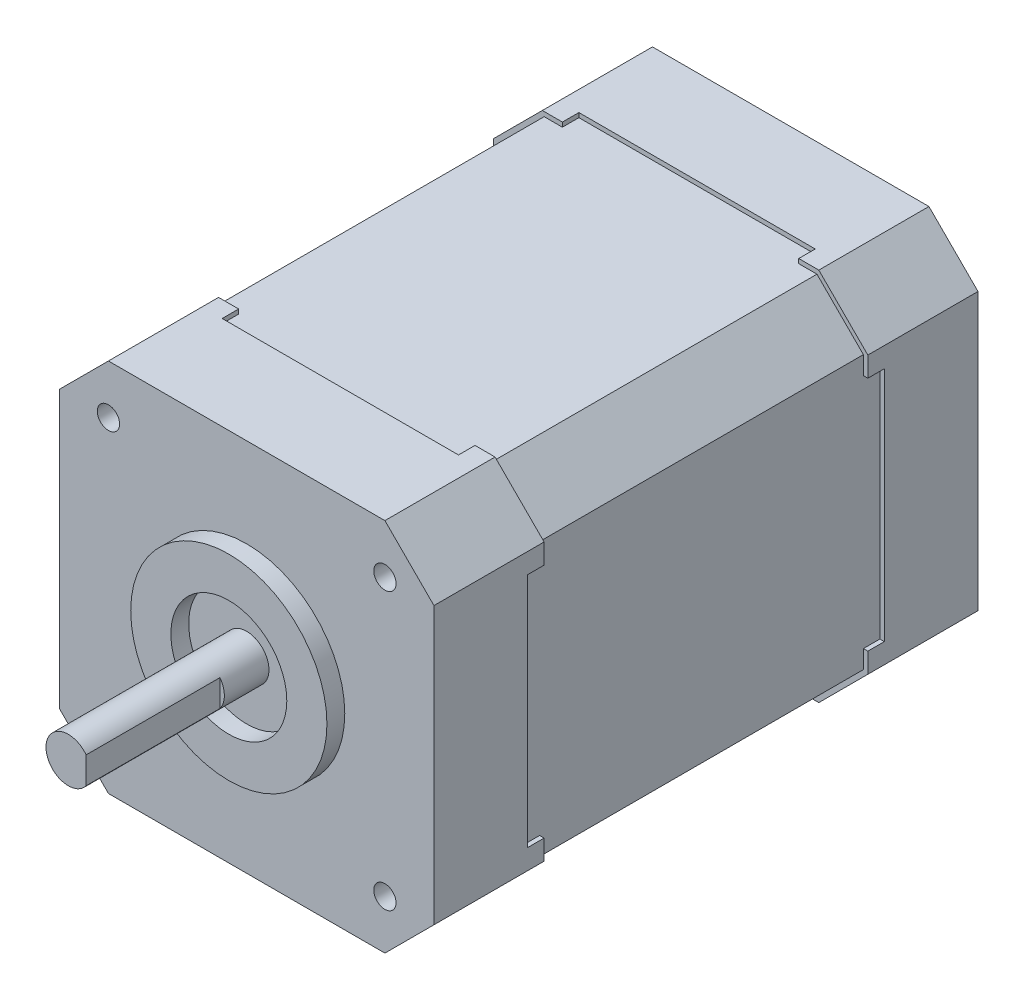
ISO-10303-21;
HEADER;
FILE_DESCRIPTION(('STEP AP214'),'2;1');
FILE_NAME('part.step','',(''),(''),'','','');
FILE_SCHEMA(('AUTOMOTIVE_DESIGN { 1 0 10303 214 1 1 1 1 }'));
ENDSEC;
DATA;
#1=APPLICATION_CONTEXT('core data for automotive mechanical design processes');
#2=APPLICATION_PROTOCOL_DEFINITION('international standard','automotive_design',2000,#1);
#3=PRODUCT_CONTEXT('',#1,'mechanical');
#4=PRODUCT('Part','Part','',(#3));
#5=PRODUCT_RELATED_PRODUCT_CATEGORY('part','',(#4));
#6=PRODUCT_DEFINITION_FORMATION('','',#4);
#7=PRODUCT_DEFINITION_CONTEXT('part definition',#1,'design');
#8=PRODUCT_DEFINITION('design','',#6,#7);
#9=PRODUCT_DEFINITION_SHAPE('','',#8);
#10=(LENGTH_UNIT() NAMED_UNIT(*) SI_UNIT(.MILLI.,.METRE.));
#11=(NAMED_UNIT(*) PLANE_ANGLE_UNIT() SI_UNIT($,.RADIAN.));
#12=(NAMED_UNIT(*) SI_UNIT($,.STERADIAN.) SOLID_ANGLE_UNIT());
#13=UNCERTAINTY_MEASURE_WITH_UNIT(LENGTH_MEASURE(1.E-05),#10,'distance_accuracy_value','');
#14=(GEOMETRIC_REPRESENTATION_CONTEXT(3) GLOBAL_UNCERTAINTY_ASSIGNED_CONTEXT((#13)) GLOBAL_UNIT_ASSIGNED_CONTEXT((#10,
#11,#12)) REPRESENTATION_CONTEXT('',''));
#15=CARTESIAN_POINT('',(0.,0.,0.));
#16=DIRECTION('',(0.,0.,1.));
#17=DIRECTION('',(1.,0.,0.));
#18=AXIS2_PLACEMENT_3D('',#15,#16,#17);
#19=CARTESIAN_POINT('',(88.0033333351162,21.,-48.65));
#20=DIRECTION('',(0.,0.,1.));
#21=DIRECTION('',(1.,0.,0.));
#22=AXIS2_PLACEMENT_3D('',#19,#20,#21);
#23=PLANE('',#22);
#24=DIRECTION('',(-1.,0.,0.));
#25=VECTOR('',#24,1.);
#26=CARTESIAN_POINT('',(88.0033333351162,13.25,-48.65));
#27=LINE('',#26,#25);
#28=CARTESIAN_POINT('',(-20.5,13.25,-48.65));
#29=VERTEX_POINT('',#28);
#30=CARTESIAN_POINT('',(-21.,13.25,-48.65));
#31=VERTEX_POINT('',#30);
#32=EDGE_CURVE('E483',#29,#31,#27,.T.);
#33=ORIENTED_EDGE('',*,*,#32,.F.);
#34=DIRECTION('',(0.,1.,0.));
#35=VECTOR('',#34,1.);
#36=CARTESIAN_POINT('',(-20.5,-15.2928932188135,-48.65));
#37=LINE('',#36,#35);
#38=CARTESIAN_POINT('',(-20.5,15.2928932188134,-48.65));
#39=VERTEX_POINT('',#38);
#40=EDGE_CURVE('E618',#29,#39,#37,.T.);
#41=ORIENTED_EDGE('',*,*,#40,.T.);
#42=DIRECTION('',(0.707106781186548,0.707106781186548,0.));
#43=VECTOR('',#42,1.);
#44=CARTESIAN_POINT('',(-20.5,15.2928932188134,-48.65));
#45=LINE('',#44,#43);
#46=CARTESIAN_POINT('',(-15.2928932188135,20.5,-48.65));
#47=VERTEX_POINT('',#46);
#48=EDGE_CURVE('E613',#39,#47,#45,.T.);
#49=ORIENTED_EDGE('',*,*,#48,.T.);
#50=DIRECTION('',(-1.,0.,0.));
#51=VECTOR('',#50,1.);
#52=CARTESIAN_POINT('',(88.0033333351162,20.5,-48.65));
#53=LINE('',#52,#51);
#54=CARTESIAN_POINT('',(-13.25,20.5,-48.65));
#55=VERTEX_POINT('',#54);
#56=EDGE_CURVE('E739',#55,#47,#53,.T.);
#57=ORIENTED_EDGE('',*,*,#56,.F.);
#58=DIRECTION('',(0.,-1.,0.));
#59=VECTOR('',#58,1.);
#60=CARTESIAN_POINT('',(-13.25,21.,-48.65));
#61=LINE('',#60,#59);
#62=CARTESIAN_POINT('',(-13.25,21.,-48.65));
#63=VERTEX_POINT('',#62);
#64=EDGE_CURVE('E602',#63,#55,#61,.T.);
#65=ORIENTED_EDGE('',*,*,#64,.F.);
#66=DIRECTION('',(-1.,0.,0.));
#67=VECTOR('',#66,1.);
#68=CARTESIAN_POINT('',(88.0033333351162,21.,-48.65));
#69=LINE('',#68,#67);
#70=CARTESIAN_POINT('',(-15.5,21.,-48.65));
#71=VERTEX_POINT('',#70);
#72=EDGE_CURVE('E727',#63,#71,#69,.T.);
#73=ORIENTED_EDGE('',*,*,#72,.T.);
#74=DIRECTION('',(0.707106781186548,0.707106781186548,0.));
#75=VECTOR('',#74,1.);
#76=CARTESIAN_POINT('',(-21.,15.5,-48.65));
#77=LINE('',#76,#75);
#78=CARTESIAN_POINT('',(-21.,15.5,-48.65));
#79=VERTEX_POINT('',#78);
#80=EDGE_CURVE('E609',#79,#71,#77,.T.);
#81=ORIENTED_EDGE('',*,*,#80,.F.);
#82=DIRECTION('',(0.,1.,0.));
#83=VECTOR('',#82,1.);
#84=CARTESIAN_POINT('',(-21.,-15.5,-48.65));
#85=LINE('',#84,#83);
#86=EDGE_CURVE('E711',#31,#79,#85,.T.);
#87=ORIENTED_EDGE('',*,*,#86,.F.);
#88=EDGE_LOOP('',(#33,#41,#49,#57,#65,#73,#81,#87));
#89=FACE_BOUND('',#88,.T.);
#90=ADVANCED_FACE('F41',(#89),#23,.T.);
#91=CARTESIAN_POINT('',(88.0033333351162,21.,-12.35));
#92=DIRECTION('',(0.,0.,-1.));
#93=DIRECTION('',(-1.,0.,0.));
#94=AXIS2_PLACEMENT_3D('',#91,#92,#93);
#95=PLANE('',#94);
#96=DIRECTION('',(1.,0.,0.));
#97=VECTOR('',#96,1.);
#98=CARTESIAN_POINT('',(88.0033333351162,13.25,-12.35));
#99=LINE('',#98,#97);
#100=CARTESIAN_POINT('',(-21.,13.25,-12.35));
#101=VERTEX_POINT('',#100);
#102=CARTESIAN_POINT('',(-20.5,13.25,-12.35));
#103=VERTEX_POINT('',#102);
#104=EDGE_CURVE('E481',#101,#103,#99,.T.);
#105=ORIENTED_EDGE('',*,*,#104,.F.);
#106=DIRECTION('',(0.,1.,0.));
#107=VECTOR('',#106,1.);
#108=CARTESIAN_POINT('',(-21.,-15.5,-12.35));
#109=LINE('',#108,#107);
#110=CARTESIAN_POINT('',(-21.,15.5,-12.35));
#111=VERTEX_POINT('',#110);
#112=EDGE_CURVE('E707',#101,#111,#109,.T.);
#113=ORIENTED_EDGE('',*,*,#112,.T.);
#114=DIRECTION('',(0.707106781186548,0.707106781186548,0.));
#115=VECTOR('',#114,1.);
#116=CARTESIAN_POINT('',(-21.,15.5,-12.35));
#117=LINE('',#116,#115);
#118=CARTESIAN_POINT('',(-15.5,21.,-12.35));
#119=VERTEX_POINT('',#118);
#120=EDGE_CURVE('E719',#111,#119,#117,.T.);
#121=ORIENTED_EDGE('',*,*,#120,.T.);
#122=DIRECTION('',(-1.,0.,0.));
#123=VECTOR('',#122,1.);
#124=CARTESIAN_POINT('',(88.0033333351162,21.,-12.35));
#125=LINE('',#124,#123);
#126=CARTESIAN_POINT('',(-13.25,21.,-12.35));
#127=VERTEX_POINT('',#126);
#128=EDGE_CURVE('E604',#127,#119,#125,.T.);
#129=ORIENTED_EDGE('',*,*,#128,.F.);
#130=DIRECTION('',(0.,1.,0.));
#131=VECTOR('',#130,1.);
#132=CARTESIAN_POINT('',(-13.25,21.,-12.35));
#133=LINE('',#132,#131);
#134=CARTESIAN_POINT('',(-13.25,20.5,-12.35));
#135=VERTEX_POINT('',#134);
#136=EDGE_CURVE('E600',#135,#127,#133,.T.);
#137=ORIENTED_EDGE('',*,*,#136,.F.);
#138=DIRECTION('',(-1.,0.,0.));
#139=VECTOR('',#138,1.);
#140=CARTESIAN_POINT('',(88.0033333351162,20.5,-12.35));
#141=LINE('',#140,#139);
#142=CARTESIAN_POINT('',(-15.2928932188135,20.5,-12.35));
#143=VERTEX_POINT('',#142);
#144=EDGE_CURVE('E736',#135,#143,#141,.T.);
#145=ORIENTED_EDGE('',*,*,#144,.T.);
#146=DIRECTION('',(0.707106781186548,0.707106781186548,0.));
#147=VECTOR('',#146,1.);
#148=CARTESIAN_POINT('',(-20.5,15.2928932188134,-12.35));
#149=LINE('',#148,#147);
#150=CARTESIAN_POINT('',(-20.5,15.2928932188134,-12.35));
#151=VERTEX_POINT('',#150);
#152=EDGE_CURVE('E716',#151,#143,#149,.T.);
#153=ORIENTED_EDGE('',*,*,#152,.F.);
#154=DIRECTION('',(0.,1.,0.));
#155=VECTOR('',#154,1.);
#156=CARTESIAN_POINT('',(-20.5,-15.2928932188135,-12.35));
#157=LINE('',#156,#155);
#158=EDGE_CURVE('E703',#103,#151,#157,.T.);
#159=ORIENTED_EDGE('',*,*,#158,.F.);
#160=EDGE_LOOP('',(#105,#113,#121,#129,#137,#145,#153,#159));
#161=FACE_BOUND('',#160,.T.);
#162=ADVANCED_FACE('F1033',(#161),#95,.T.);
#163=DIRECTION('',(1.,0.,0.));
#164=VECTOR('',#163,1.);
#165=CARTESIAN_POINT('',(88.0033333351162,-13.25,-48.65));
#166=LINE('',#165,#164);
#167=CARTESIAN_POINT('',(-21.,-13.25,-48.65));
#168=VERTEX_POINT('',#167);
#169=CARTESIAN_POINT('',(-20.5,-13.25,-48.65));
#170=VERTEX_POINT('',#169);
#171=EDGE_CURVE('E479',#168,#170,#166,.T.);
#172=ORIENTED_EDGE('',*,*,#171,.F.);
#173=CARTESIAN_POINT('',(-21.,-15.5,-48.65));
#174=VERTEX_POINT('',#173);
#175=EDGE_CURVE('E614',#174,#168,#85,.T.);
#176=ORIENTED_EDGE('',*,*,#175,.F.);
#177=DIRECTION('',(-0.707106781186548,0.707106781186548,0.));
#178=VECTOR('',#177,1.);
#179=CARTESIAN_POINT('',(-15.5,-21.,-48.65));
#180=LINE('',#179,#178);
#181=CARTESIAN_POINT('',(-15.5,-21.,-48.65));
#182=VERTEX_POINT('',#181);
#183=EDGE_CURVE('E695',#182,#174,#180,.T.);
#184=ORIENTED_EDGE('',*,*,#183,.F.);
#185=DIRECTION('',(-1.,0.,0.));
#186=VECTOR('',#185,1.);
#187=CARTESIAN_POINT('',(15.5,-21.,-48.65));
#188=LINE('',#187,#186);
#189=CARTESIAN_POINT('',(-13.25,-21.,-48.65));
#190=VERTEX_POINT('',#189);
#191=EDGE_CURVE('E684',#190,#182,#188,.T.);
#192=ORIENTED_EDGE('',*,*,#191,.F.);
#193=DIRECTION('',(0.,-1.,0.));
#194=VECTOR('',#193,1.);
#195=CARTESIAN_POINT('',(-13.25,21.,-48.65));
#196=LINE('',#195,#194);
#197=CARTESIAN_POINT('',(-13.25,-20.5,-48.65));
#198=VERTEX_POINT('',#197);
#199=EDGE_CURVE('E522',#198,#190,#196,.T.);
#200=ORIENTED_EDGE('',*,*,#199,.F.);
#201=DIRECTION('',(-1.,0.,0.));
#202=VECTOR('',#201,1.);
#203=CARTESIAN_POINT('',(15.2928932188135,-20.5,-48.65));
#204=LINE('',#203,#202);
#205=CARTESIAN_POINT('',(-15.2928932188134,-20.5,-48.65));
#206=VERTEX_POINT('',#205);
#207=EDGE_CURVE('E688',#198,#206,#204,.T.);
#208=ORIENTED_EDGE('',*,*,#207,.T.);
#209=DIRECTION('',(-0.707106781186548,0.707106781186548,0.));
#210=VECTOR('',#209,1.);
#211=CARTESIAN_POINT('',(-15.2928932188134,-20.5,-48.65));
#212=LINE('',#211,#210);
#213=CARTESIAN_POINT('',(-20.5,-15.2928932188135,-48.65));
#214=VERTEX_POINT('',#213);
#215=EDGE_CURVE('E619',#206,#214,#212,.T.);
#216=ORIENTED_EDGE('',*,*,#215,.T.);
#217=EDGE_CURVE('E700',#214,#170,#37,.T.);
#218=ORIENTED_EDGE('',*,*,#217,.T.);
#219=EDGE_LOOP('',(#172,#176,#184,#192,#200,#208,#216,#218));
#220=FACE_BOUND('',#219,.T.);
#221=ADVANCED_FACE('F916',(#220),#23,.T.);
#222=DIRECTION('',(-1.,0.,0.));
#223=VECTOR('',#222,1.);
#224=CARTESIAN_POINT('',(88.0033333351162,-13.25,-12.35));
#225=LINE('',#224,#223);
#226=CARTESIAN_POINT('',(-20.5,-13.25,-12.35));
#227=VERTEX_POINT('',#226);
#228=CARTESIAN_POINT('',(-21.,-13.25,-12.35));
#229=VERTEX_POINT('',#228);
#230=EDGE_CURVE('E56',#227,#229,#225,.T.);
#231=ORIENTED_EDGE('',*,*,#230,.F.);
#232=CARTESIAN_POINT('',(-20.5,-15.2928932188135,-12.35));
#233=VERTEX_POINT('',#232);
#234=EDGE_CURVE('E704',#233,#227,#157,.T.);
#235=ORIENTED_EDGE('',*,*,#234,.F.);
#236=DIRECTION('',(-0.707106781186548,0.707106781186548,0.));
#237=VECTOR('',#236,1.);
#238=CARTESIAN_POINT('',(-15.2928932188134,-20.5,-12.35));
#239=LINE('',#238,#237);
#240=CARTESIAN_POINT('',(-15.2928932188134,-20.5,-12.35));
#241=VERTEX_POINT('',#240);
#242=EDGE_CURVE('E623',#241,#233,#239,.T.);
#243=ORIENTED_EDGE('',*,*,#242,.F.);
#244=DIRECTION('',(-1.,0.,0.));
#245=VECTOR('',#244,1.);
#246=CARTESIAN_POINT('',(15.2928932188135,-20.5,-12.35));
#247=LINE('',#246,#245);
#248=CARTESIAN_POINT('',(-13.25,-20.5,-12.35));
#249=VERTEX_POINT('',#248);
#250=EDGE_CURVE('E676',#249,#241,#247,.T.);
#251=ORIENTED_EDGE('',*,*,#250,.F.);
#252=DIRECTION('',(0.,1.,0.));
#253=VECTOR('',#252,1.);
#254=CARTESIAN_POINT('',(-13.25,21.,-12.35));
#255=LINE('',#254,#253);
#256=CARTESIAN_POINT('',(-13.25,-21.,-12.35));
#257=VERTEX_POINT('',#256);
#258=EDGE_CURVE('E519',#257,#249,#255,.T.);
#259=ORIENTED_EDGE('',*,*,#258,.F.);
#260=DIRECTION('',(-1.,0.,0.));
#261=VECTOR('',#260,1.);
#262=CARTESIAN_POINT('',(15.5,-21.,-12.35));
#263=LINE('',#262,#261);
#264=CARTESIAN_POINT('',(-15.5,-21.,-12.35));
#265=VERTEX_POINT('',#264);
#266=EDGE_CURVE('E680',#257,#265,#263,.T.);
#267=ORIENTED_EDGE('',*,*,#266,.T.);
#268=DIRECTION('',(-0.707106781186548,0.707106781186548,0.));
#269=VECTOR('',#268,1.);
#270=CARTESIAN_POINT('',(-15.5,-21.,-12.35));
#271=LINE('',#270,#269);
#272=CARTESIAN_POINT('',(-21.,-15.5,-12.35));
#273=VERTEX_POINT('',#272);
#274=EDGE_CURVE('E693',#265,#273,#271,.T.);
#275=ORIENTED_EDGE('',*,*,#274,.T.);
#276=EDGE_CURVE('E708',#273,#229,#109,.T.);
#277=ORIENTED_EDGE('',*,*,#276,.T.);
#278=EDGE_LOOP('',(#231,#235,#243,#251,#259,#267,#275,#277));
#279=FACE_BOUND('',#278,.T.);
#280=ADVANCED_FACE('F992',(#279),#95,.T.);
#281=DIRECTION('',(-1.,0.,0.));
#282=VECTOR('',#281,1.);
#283=CARTESIAN_POINT('',(88.0033333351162,13.25,-48.65));
#284=LINE('',#283,#282);
#285=CARTESIAN_POINT('',(21.,13.25,-48.65));
#286=VERTEX_POINT('',#285);
#287=CARTESIAN_POINT('',(20.5,13.25,-48.65));
#288=VERTEX_POINT('',#287);
#289=EDGE_CURVE('E562',#286,#288,#284,.T.);
#290=ORIENTED_EDGE('',*,*,#289,.F.);
#291=DIRECTION('',(0.,-1.,0.));
#292=VECTOR('',#291,1.);
#293=CARTESIAN_POINT('',(21.,15.5,-48.65));
#294=LINE('',#293,#292);
#295=CARTESIAN_POINT('',(21.,15.5,-48.65));
#296=VERTEX_POINT('',#295);
#297=EDGE_CURVE('E648',#296,#286,#294,.T.);
#298=ORIENTED_EDGE('',*,*,#297,.F.);
#299=DIRECTION('',(0.707106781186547,-0.707106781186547,0.));
#300=VECTOR('',#299,1.);
#301=CARTESIAN_POINT('',(15.5,21.,-48.65));
#302=LINE('',#301,#300);
#303=CARTESIAN_POINT('',(15.5,21.,-48.65));
#304=VERTEX_POINT('',#303);
#305=EDGE_CURVE('E633',#304,#296,#302,.T.);
#306=ORIENTED_EDGE('',*,*,#305,.F.);
#307=CARTESIAN_POINT('',(13.25,21.,-48.65));
#308=VERTEX_POINT('',#307);
#309=EDGE_CURVE('E730',#304,#308,#69,.T.);
#310=ORIENTED_EDGE('',*,*,#309,.T.);
#311=DIRECTION('',(0.,1.,0.));
#312=VECTOR('',#311,1.);
#313=CARTESIAN_POINT('',(13.25,21.,-48.65));
#314=LINE('',#313,#312);
#315=CARTESIAN_POINT('',(13.25,20.5,-48.65));
#316=VERTEX_POINT('',#315);
#317=EDGE_CURVE('E598',#316,#308,#314,.T.);
#318=ORIENTED_EDGE('',*,*,#317,.F.);
#319=CARTESIAN_POINT('',(15.2928932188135,20.5,-48.65));
#320=VERTEX_POINT('',#319);
#321=EDGE_CURVE('E742',#320,#316,#53,.T.);
#322=ORIENTED_EDGE('',*,*,#321,.F.);
#323=DIRECTION('',(0.707106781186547,-0.707106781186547,0.));
#324=VECTOR('',#323,1.);
#325=CARTESIAN_POINT('',(15.2928932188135,20.5,-48.65));
#326=LINE('',#325,#324);
#327=CARTESIAN_POINT('',(20.5,15.2928932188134,-48.65));
#328=VERTEX_POINT('',#327);
#329=EDGE_CURVE('E637',#320,#328,#326,.T.);
#330=ORIENTED_EDGE('',*,*,#329,.T.);
#331=DIRECTION('',(0.,-1.,0.));
#332=VECTOR('',#331,1.);
#333=CARTESIAN_POINT('',(20.5,15.2928932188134,-48.65));
#334=LINE('',#333,#332);
#335=EDGE_CURVE('E652',#328,#288,#334,.T.);
#336=ORIENTED_EDGE('',*,*,#335,.T.);
#337=EDGE_LOOP('',(#290,#298,#306,#310,#318,#322,#330,#336));
#338=FACE_BOUND('',#337,.T.);
#339=ADVANCED_FACE('F882',(#338),#23,.T.);
#340=DIRECTION('',(1.,0.,0.));
#341=VECTOR('',#340,1.);
#342=CARTESIAN_POINT('',(88.0033333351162,13.25,-12.35));
#343=LINE('',#342,#341);
#344=CARTESIAN_POINT('',(20.5,13.25,-12.35));
#345=VERTEX_POINT('',#344);
#346=CARTESIAN_POINT('',(21.,13.25,-12.35));
#347=VERTEX_POINT('',#346);
#348=EDGE_CURVE('E560',#345,#347,#343,.T.);
#349=ORIENTED_EDGE('',*,*,#348,.F.);
#350=DIRECTION('',(0.,-1.,0.));
#351=VECTOR('',#350,1.);
#352=CARTESIAN_POINT('',(20.5,15.2928932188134,-12.35));
#353=LINE('',#352,#351);
#354=CARTESIAN_POINT('',(20.5,15.2928932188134,-12.35));
#355=VERTEX_POINT('',#354);
#356=EDGE_CURVE('E656',#355,#345,#353,.T.);
#357=ORIENTED_EDGE('',*,*,#356,.F.);
#358=DIRECTION('',(0.707106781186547,-0.707106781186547,0.));
#359=VECTOR('',#358,1.);
#360=CARTESIAN_POINT('',(15.2928932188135,20.5,-12.35));
#361=LINE('',#360,#359);
#362=CARTESIAN_POINT('',(15.2928932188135,20.5,-12.35));
#363=VERTEX_POINT('',#362);
#364=EDGE_CURVE('E640',#363,#355,#361,.T.);
#365=ORIENTED_EDGE('',*,*,#364,.F.);
#366=CARTESIAN_POINT('',(13.25,20.5,-12.35));
#367=VERTEX_POINT('',#366);
#368=EDGE_CURVE('E634',#363,#367,#141,.T.);
#369=ORIENTED_EDGE('',*,*,#368,.T.);
#370=DIRECTION('',(0.,-1.,0.));
#371=VECTOR('',#370,1.);
#372=CARTESIAN_POINT('',(13.25,21.,-12.35));
#373=LINE('',#372,#371);
#374=CARTESIAN_POINT('',(13.25,21.,-12.35));
#375=VERTEX_POINT('',#374);
#376=EDGE_CURVE('E595',#375,#367,#373,.T.);
#377=ORIENTED_EDGE('',*,*,#376,.F.);
#378=CARTESIAN_POINT('',(15.5,21.,-12.35));
#379=VERTEX_POINT('',#378);
#380=EDGE_CURVE('E724',#379,#375,#125,.T.);
#381=ORIENTED_EDGE('',*,*,#380,.F.);
#382=DIRECTION('',(0.707106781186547,-0.707106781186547,0.));
#383=VECTOR('',#382,1.);
#384=CARTESIAN_POINT('',(15.5,21.,-12.35));
#385=LINE('',#384,#383);
#386=CARTESIAN_POINT('',(21.,15.5,-12.35));
#387=VERTEX_POINT('',#386);
#388=EDGE_CURVE('E629',#379,#387,#385,.T.);
#389=ORIENTED_EDGE('',*,*,#388,.T.);
#390=DIRECTION('',(0.,-1.,0.));
#391=VECTOR('',#390,1.);
#392=CARTESIAN_POINT('',(21.,15.5,-12.35));
#393=LINE('',#392,#391);
#394=EDGE_CURVE('E644',#387,#347,#393,.T.);
#395=ORIENTED_EDGE('',*,*,#394,.T.);
#396=EDGE_LOOP('',(#349,#357,#365,#369,#377,#381,#389,#395));
#397=FACE_BOUND('',#396,.T.);
#398=ADVANCED_FACE('F1050',(#397),#95,.T.);
#399=CARTESIAN_POINT('',(-15.5,21.,-61.));
#400=DIRECTION('',(0.,1.,0.));
#401=DIRECTION('',(0.,0.,1.));
#402=AXIS2_PLACEMENT_3D('',#399,#400,#401);
#403=PLANE('',#402);
#404=DIRECTION('',(0.,0.,1.));
#405=VECTOR('',#404,1.);
#406=CARTESIAN_POINT('',(-13.25,21.,-50.5));
#407=LINE('',#406,#405);
#408=CARTESIAN_POINT('',(-13.25,21.,-10.5));
#409=VERTEX_POINT('',#408);
#410=EDGE_CURVE('E564',#127,#409,#407,.T.);
#411=ORIENTED_EDGE('',*,*,#410,.F.);
#412=ORIENTED_EDGE('',*,*,#128,.T.);
#413=DIRECTION('',(0.,0.,1.));
#414=VECTOR('',#413,1.);
#415=CARTESIAN_POINT('',(-15.5,21.,-61.));
#416=LINE('',#415,#414);
#417=CARTESIAN_POINT('',(-15.5,21.,0.));
#418=VERTEX_POINT('',#417);
#419=EDGE_CURVE('E797',#119,#418,#416,.T.);
#420=ORIENTED_EDGE('',*,*,#419,.T.);
#421=DIRECTION('',(-1.,0.,0.));
#422=VECTOR('',#421,1.);
#423=CARTESIAN_POINT('',(-15.5,21.,0.));
#424=LINE('',#423,#422);
#425=CARTESIAN_POINT('',(15.5,21.,0.));
#426=VERTEX_POINT('',#425);
#427=EDGE_CURVE('E771',#426,#418,#424,.T.);
#428=ORIENTED_EDGE('',*,*,#427,.F.);
#429=DIRECTION('',(0.,0.,1.));
#430=VECTOR('',#429,1.);
#431=CARTESIAN_POINT('',(15.5,21.,-61.));
#432=LINE('',#431,#430);
#433=EDGE_CURVE('E824',#379,#426,#432,.T.);
#434=ORIENTED_EDGE('',*,*,#433,.F.);
#435=ORIENTED_EDGE('',*,*,#380,.T.);
#436=DIRECTION('',(0.,0.,-1.));
#437=VECTOR('',#436,1.);
#438=CARTESIAN_POINT('',(13.25,21.,-50.5));
#439=LINE('',#438,#437);
#440=CARTESIAN_POINT('',(13.25,21.,-10.5));
#441=VERTEX_POINT('',#440);
#442=EDGE_CURVE('E579',#441,#375,#439,.T.);
#443=ORIENTED_EDGE('',*,*,#442,.F.);
#444=DIRECTION('',(1.,0.,0.));
#445=VECTOR('',#444,1.);
#446=CARTESIAN_POINT('',(-13.25,21.,-10.5));
#447=LINE('',#446,#445);
#448=EDGE_CURVE('E576',#409,#441,#447,.T.);
#449=ORIENTED_EDGE('',*,*,#448,.F.);
#450=EDGE_LOOP('',(#411,#412,#420,#428,#434,#435,#443,#449));
#451=FACE_BOUND('',#450,.T.);
#452=ADVANCED_FACE('F1055',(#451),#403,.T.);
#453=CARTESIAN_POINT('',(15.5,21.,-61.));
#454=DIRECTION('',(0.707106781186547,0.707106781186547,0.));
#455=DIRECTION('',(-0.707106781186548,0.707106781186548,0.));
#456=AXIS2_PLACEMENT_3D('',#453,#454,#455);
#457=PLANE('',#456);
#458=DIRECTION('',(0.,0.,1.));
#459=VECTOR('',#458,1.);
#460=CARTESIAN_POINT('',(21.,15.5,-61.));
#461=LINE('',#460,#459);
#462=CARTESIAN_POINT('',(21.,15.5,0.));
#463=VERTEX_POINT('',#462);
#464=EDGE_CURVE('E828',#387,#463,#461,.T.);
#465=ORIENTED_EDGE('',*,*,#464,.F.);
#466=ORIENTED_EDGE('',*,*,#388,.F.);
#467=ORIENTED_EDGE('',*,*,#433,.T.);
#468=DIRECTION('',(-0.707106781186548,0.707106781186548,0.));
#469=VECTOR('',#468,1.);
#470=CARTESIAN_POINT('',(15.5,21.,0.));
#471=LINE('',#470,#469);
#472=EDGE_CURVE('E776',#463,#426,#471,.T.);
#473=ORIENTED_EDGE('',*,*,#472,.F.);
#474=EDGE_LOOP('',(#465,#466,#467,#473));
#475=FACE_BOUND('',#474,.T.);
#476=ADVANCED_FACE('F1112',(#475),#457,.T.);
#477=CARTESIAN_POINT('',(21.,15.5,-61.));
#478=DIRECTION('',(1.,0.,0.));
#479=DIRECTION('',(0.,1.,0.));
#480=AXIS2_PLACEMENT_3D('',#477,#478,#479);
#481=PLANE('',#480);
#482=DIRECTION('',(0.,0.,1.));
#483=VECTOR('',#482,1.);
#484=CARTESIAN_POINT('',(21.,13.25,-10.5));
#485=LINE('',#484,#483);
#486=CARTESIAN_POINT('',(21.,13.25,-10.5));
#487=VERTEX_POINT('',#486);
#488=EDGE_CURVE('E541',#347,#487,#485,.T.);
#489=ORIENTED_EDGE('',*,*,#488,.F.);
#490=ORIENTED_EDGE('',*,*,#394,.F.);
#491=ORIENTED_EDGE('',*,*,#464,.T.);
#492=DIRECTION('',(0.,1.,0.));
#493=VECTOR('',#492,1.);
#494=CARTESIAN_POINT('',(21.,15.5,0.));
#495=LINE('',#494,#493);
#496=CARTESIAN_POINT('',(21.,-15.5,0.));
#497=VERTEX_POINT('',#496);
#498=EDGE_CURVE('E815',#497,#463,#495,.T.);
#499=ORIENTED_EDGE('',*,*,#498,.F.);
#500=DIRECTION('',(0.,0.,1.));
#501=VECTOR('',#500,1.);
#502=CARTESIAN_POINT('',(21.,-15.5,-61.));
#503=LINE('',#502,#501);
#504=CARTESIAN_POINT('',(21.,-15.5,-12.35));
#505=VERTEX_POINT('',#504);
#506=EDGE_CURVE('E832',#505,#497,#503,.T.);
#507=ORIENTED_EDGE('',*,*,#506,.F.);
#508=CARTESIAN_POINT('',(21.,-13.25,-12.35));
#509=VERTEX_POINT('',#508);
#510=EDGE_CURVE('E628',#509,#505,#393,.T.);
#511=ORIENTED_EDGE('',*,*,#510,.F.);
#512=DIRECTION('',(0.,0.,-1.));
#513=VECTOR('',#512,1.);
#514=CARTESIAN_POINT('',(21.,-13.25,-10.5));
#515=LINE('',#514,#513);
#516=CARTESIAN_POINT('',(21.,-13.25,-10.5));
#517=VERTEX_POINT('',#516);
#518=EDGE_CURVE('E536',#517,#509,#515,.T.);
#519=ORIENTED_EDGE('',*,*,#518,.F.);
#520=DIRECTION('',(0.,-1.,0.));
#521=VECTOR('',#520,1.);
#522=CARTESIAN_POINT('',(21.,13.25,-10.5));
#523=LINE('',#522,#521);
#524=EDGE_CURVE('E524',#487,#517,#523,.T.);
#525=ORIENTED_EDGE('',*,*,#524,.F.);
#526=EDGE_LOOP('',(#489,#490,#491,#499,#507,#511,#519,#525));
#527=FACE_BOUND('',#526,.T.);
#528=ADVANCED_FACE('F1115',(#527),#481,.T.);
#529=CARTESIAN_POINT('',(15.5,-21.,-61.));
#530=DIRECTION('',(0.707106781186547,-0.707106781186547,0.));
#531=DIRECTION('',(0.707106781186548,0.707106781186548,0.));
#532=AXIS2_PLACEMENT_3D('',#529,#530,#531);
#533=PLANE('',#532);
#534=DIRECTION('',(0.,0.,1.));
#535=VECTOR('',#534,1.);
#536=CARTESIAN_POINT('',(15.5,-21.,-61.));
#537=LINE('',#536,#535);
#538=CARTESIAN_POINT('',(15.5,-21.,-12.35));
#539=VERTEX_POINT('',#538);
#540=CARTESIAN_POINT('',(15.5,-21.,0.));
#541=VERTEX_POINT('',#540);
#542=EDGE_CURVE('E836',#539,#541,#537,.T.);
#543=ORIENTED_EDGE('',*,*,#542,.F.);
#544=DIRECTION('',(-0.707106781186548,-0.707106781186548,0.));
#545=VECTOR('',#544,1.);
#546=CARTESIAN_POINT('',(21.,-15.5,-12.35));
#547=LINE('',#546,#545);
#548=EDGE_CURVE('E662',#505,#539,#547,.T.);
#549=ORIENTED_EDGE('',*,*,#548,.F.);
#550=ORIENTED_EDGE('',*,*,#506,.T.);
#551=DIRECTION('',(0.707106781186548,0.707106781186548,0.));
#552=VECTOR('',#551,1.);
#553=CARTESIAN_POINT('',(15.5,-21.,0.));
#554=LINE('',#553,#552);
#555=EDGE_CURVE('E812',#541,#497,#554,.T.);
#556=ORIENTED_EDGE('',*,*,#555,.F.);
#557=EDGE_LOOP('',(#543,#549,#550,#556));
#558=FACE_BOUND('',#557,.T.);
#559=ADVANCED_FACE('F1118',(#558),#533,.T.);
#560=CARTESIAN_POINT('',(-15.5,-21.,-61.));
#561=DIRECTION('',(0.,-1.,0.));
#562=DIRECTION('',(1.,0.,0.));
#563=AXIS2_PLACEMENT_3D('',#560,#561,#562);
#564=PLANE('',#563);
#565=DIRECTION('',(0.,0.,-1.));
#566=VECTOR('',#565,1.);
#567=CARTESIAN_POINT('',(-13.25,-21.,-10.5));
#568=LINE('',#567,#566);
#569=CARTESIAN_POINT('',(-13.25,-21.,-10.5));
#570=VERTEX_POINT('',#569);
#571=EDGE_CURVE('E485',#570,#257,#568,.T.);
#572=ORIENTED_EDGE('',*,*,#571,.F.);
#573=DIRECTION('',(-1.,0.,0.));
#574=VECTOR('',#573,1.);
#575=CARTESIAN_POINT('',(-13.25,-21.,-10.5));
#576=LINE('',#575,#574);
#577=CARTESIAN_POINT('',(13.25,-21.,-10.5));
#578=VERTEX_POINT('',#577);
#579=EDGE_CURVE('E502',#578,#570,#576,.T.);
#580=ORIENTED_EDGE('',*,*,#579,.F.);
#581=DIRECTION('',(0.,0.,1.));
#582=VECTOR('',#581,1.);
#583=CARTESIAN_POINT('',(13.25,-21.,-10.5));
#584=LINE('',#583,#582);
#585=CARTESIAN_POINT('',(13.25,-21.,-12.35));
#586=VERTEX_POINT('',#585);
#587=EDGE_CURVE('E499',#586,#578,#584,.T.);
#588=ORIENTED_EDGE('',*,*,#587,.F.);
#589=EDGE_CURVE('E681',#539,#586,#263,.T.);
#590=ORIENTED_EDGE('',*,*,#589,.F.);
#591=ORIENTED_EDGE('',*,*,#542,.T.);
#592=DIRECTION('',(1.,0.,0.));
#593=VECTOR('',#592,1.);
#594=CARTESIAN_POINT('',(-15.5,-21.,0.));
#595=LINE('',#594,#593);
#596=CARTESIAN_POINT('',(-15.5,-21.,0.));
#597=VERTEX_POINT('',#596);
#598=EDGE_CURVE('E809',#597,#541,#595,.T.);
#599=ORIENTED_EDGE('',*,*,#598,.F.);
#600=DIRECTION('',(0.,0.,1.));
#601=VECTOR('',#600,1.);
#602=CARTESIAN_POINT('',(-15.5,-21.,-61.));
#603=LINE('',#602,#601);
#604=EDGE_CURVE('E840',#265,#597,#603,.T.);
#605=ORIENTED_EDGE('',*,*,#604,.F.);
#606=ORIENTED_EDGE('',*,*,#266,.F.);
#607=EDGE_LOOP('',(#572,#580,#588,#590,#591,#599,#605,#606));
#608=FACE_BOUND('',#607,.T.);
#609=ADVANCED_FACE('F983',(#608),#564,.T.);
#610=CARTESIAN_POINT('',(-21.,-15.5,-61.));
#611=DIRECTION('',(-0.707106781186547,-0.707106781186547,0.));
#612=DIRECTION('',(0.707106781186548,-0.707106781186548,0.));
#613=AXIS2_PLACEMENT_3D('',#610,#611,#612);
#614=PLANE('',#613);
#615=DIRECTION('',(0.,0.,1.));
#616=VECTOR('',#615,1.);
#617=CARTESIAN_POINT('',(-21.,-15.5,-61.));
#618=LINE('',#617,#616);
#619=CARTESIAN_POINT('',(-21.,-15.5,0.));
#620=VERTEX_POINT('',#619);
#621=EDGE_CURVE('E844',#273,#620,#618,.T.);
#622=ORIENTED_EDGE('',*,*,#621,.F.);
#623=ORIENTED_EDGE('',*,*,#274,.F.);
#624=ORIENTED_EDGE('',*,*,#604,.T.);
#625=DIRECTION('',(0.707106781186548,-0.707106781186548,0.));
#626=VECTOR('',#625,1.);
#627=CARTESIAN_POINT('',(-21.,-15.5,0.));
#628=LINE('',#627,#626);
#629=EDGE_CURVE('E806',#620,#597,#628,.T.);
#630=ORIENTED_EDGE('',*,*,#629,.F.);
#631=EDGE_LOOP('',(#622,#623,#624,#630));
#632=FACE_BOUND('',#631,.T.);
#633=ADVANCED_FACE('F1123',(#632),#614,.T.);
#634=CARTESIAN_POINT('',(-21.,15.5,-61.));
#635=DIRECTION('',(-1.,0.,0.));
#636=DIRECTION('',(0.,-1.,0.));
#637=AXIS2_PLACEMENT_3D('',#634,#635,#636);
#638=PLANE('',#637);
#639=DIRECTION('',(0.,0.,-1.));
#640=VECTOR('',#639,1.);
#641=CARTESIAN_POINT('',(-21.,13.25,-50.5));
#642=LINE('',#641,#640);
#643=CARTESIAN_POINT('',(-21.,13.25,-10.5));
#644=VERTEX_POINT('',#643);
#645=EDGE_CURVE('E466',#644,#101,#642,.T.);
#646=ORIENTED_EDGE('',*,*,#645,.F.);
#647=DIRECTION('',(0.,1.,0.));
#648=VECTOR('',#647,1.);
#649=CARTESIAN_POINT('',(-21.,13.25,-10.5));
#650=LINE('',#649,#648);
#651=CARTESIAN_POINT('',(-21.,-13.25,-10.5));
#652=VERTEX_POINT('',#651);
#653=EDGE_CURVE('E463',#652,#644,#650,.T.);
#654=ORIENTED_EDGE('',*,*,#653,.F.);
#655=DIRECTION('',(0.,0.,1.));
#656=VECTOR('',#655,1.);
#657=CARTESIAN_POINT('',(-21.,-13.25,-50.5));
#658=LINE('',#657,#656);
#659=EDGE_CURVE('E460',#229,#652,#658,.T.);
#660=ORIENTED_EDGE('',*,*,#659,.F.);
#661=ORIENTED_EDGE('',*,*,#276,.F.);
#662=ORIENTED_EDGE('',*,*,#621,.T.);
#663=DIRECTION('',(0.,-1.,0.));
#664=VECTOR('',#663,1.);
#665=CARTESIAN_POINT('',(-21.,15.5,0.));
#666=LINE('',#665,#664);
#667=CARTESIAN_POINT('',(-21.,15.5,0.));
#668=VERTEX_POINT('',#667);
#669=EDGE_CURVE('E803',#668,#620,#666,.T.);
#670=ORIENTED_EDGE('',*,*,#669,.F.);
#671=DIRECTION('',(0.,0.,1.));
#672=VECTOR('',#671,1.);
#673=CARTESIAN_POINT('',(-21.,15.5,-61.));
#674=LINE('',#673,#672);
#675=EDGE_CURVE('E848',#111,#668,#674,.T.);
#676=ORIENTED_EDGE('',*,*,#675,.F.);
#677=ORIENTED_EDGE('',*,*,#112,.F.);
#678=EDGE_LOOP('',(#646,#654,#660,#661,#662,#670,#676,#677));
#679=FACE_BOUND('',#678,.T.);
#680=ADVANCED_FACE('F1125',(#679),#638,.T.);
#681=CARTESIAN_POINT('',(-21.,15.5,-61.));
#682=DIRECTION('',(-0.707106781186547,0.707106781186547,0.));
#683=DIRECTION('',(-0.707106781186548,-0.707106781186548,0.));
#684=AXIS2_PLACEMENT_3D('',#681,#682,#683);
#685=PLANE('',#684);
#686=ORIENTED_EDGE('',*,*,#419,.F.);
#687=ORIENTED_EDGE('',*,*,#120,.F.);
#688=ORIENTED_EDGE('',*,*,#675,.T.);
#689=DIRECTION('',(-0.707106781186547,-0.707106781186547,0.));
#690=VECTOR('',#689,1.);
#691=CARTESIAN_POINT('',(-21.,15.5,0.));
#692=LINE('',#691,#690);
#693=EDGE_CURVE('E800',#418,#668,#692,.T.);
#694=ORIENTED_EDGE('',*,*,#693,.F.);
#695=EDGE_LOOP('',(#686,#687,#688,#694));
#696=FACE_BOUND('',#695,.T.);
#697=ADVANCED_FACE('F1108',(#696),#685,.T.);
#698=CARTESIAN_POINT('',(21.,21.,0.));
#699=DIRECTION('',(0.,0.,-1.));
#700=DIRECTION('',(-1.,0.,0.));
#701=AXIS2_PLACEMENT_3D('',#698,#699,#700);
#702=PLANE('',#701);
#703=CARTESIAN_POINT('',(0.,0.,0.));
#704=DIRECTION('',(0.,0.,1.));
#705=DIRECTION('',(1.,0.,0.));
#706=AXIS2_PLACEMENT_3D('',#703,#704,#705);
#707=CIRCLE('',#706,6.5);
#708=CARTESIAN_POINT('',(6.5,0.,0.));
#709=VERTEX_POINT('',#708);
#710=EDGE_CURVE('E762',#709,#709,#707,.T.);
#711=ORIENTED_EDGE('',*,*,#710,.T.);
#712=EDGE_LOOP('',(#711));
#713=FACE_BOUND('',#712,.T.);
#714=CARTESIAN_POINT('',(0.,0.,0.));
#715=DIRECTION('',(0.,0.,-1.));
#716=DIRECTION('',(-1.,0.,0.));
#717=AXIS2_PLACEMENT_3D('',#714,#715,#716);
#718=CIRCLE('',#717,2.5);
#719=CARTESIAN_POINT('',(-2.5,0.,0.));
#720=VERTEX_POINT('',#719);
#721=EDGE_CURVE('E854',#720,#720,#718,.F.);
#722=ORIENTED_EDGE('',*,*,#721,.F.);
#723=EDGE_LOOP('',(#722));
#724=FACE_BOUND('',#723,.T.);
#725=ADVANCED_FACE('F1105',(#713,#724),#702,.F.);
#726=CARTESIAN_POINT('',(-15.5,15.5,0.));
#727=DIRECTION('',(0.,0.,1.));
#728=DIRECTION('',(1.,0.,0.));
#729=AXIS2_PLACEMENT_3D('',#726,#727,#728);
#730=CIRCLE('',#729,1.25);
#731=CARTESIAN_POINT('',(-14.25,15.5,0.));
#732=VERTEX_POINT('',#731);
#733=EDGE_CURVE('E428',#732,#732,#730,.T.);
#734=ORIENTED_EDGE('',*,*,#733,.F.);
#735=EDGE_LOOP('',(#734));
#736=FACE_BOUND('',#735,.T.);
#737=CARTESIAN_POINT('',(15.5,15.5,0.));
#738=DIRECTION('',(0.,0.,1.));
#739=DIRECTION('',(1.,0.,0.));
#740=AXIS2_PLACEMENT_3D('',#737,#738,#739);
#741=CIRCLE('',#740,1.25);
#742=CARTESIAN_POINT('',(16.75,15.5,0.));
#743=VERTEX_POINT('',#742);
#744=EDGE_CURVE('E427',#743,#743,#741,.T.);
#745=ORIENTED_EDGE('',*,*,#744,.F.);
#746=EDGE_LOOP('',(#745));
#747=FACE_BOUND('',#746,.T.);
#748=CARTESIAN_POINT('',(15.5,-15.5,0.));
#749=DIRECTION('',(0.,0.,1.));
#750=DIRECTION('',(1.,0.,0.));
#751=AXIS2_PLACEMENT_3D('',#748,#749,#750);
#752=CIRCLE('',#751,1.25);
#753=CARTESIAN_POINT('',(16.75,-15.5,0.));
#754=VERTEX_POINT('',#753);
#755=EDGE_CURVE('E438',#754,#754,#752,.T.);
#756=ORIENTED_EDGE('',*,*,#755,.F.);
#757=EDGE_LOOP('',(#756));
#758=FACE_BOUND('',#757,.T.);
#759=CARTESIAN_POINT('',(-15.5,-15.5,0.));
#760=DIRECTION('',(0.,0.,1.));
#761=DIRECTION('',(1.,0.,0.));
#762=AXIS2_PLACEMENT_3D('',#759,#760,#761);
#763=CIRCLE('',#762,1.25);
#764=CARTESIAN_POINT('',(-14.25,-15.5,0.));
#765=VERTEX_POINT('',#764);
#766=EDGE_CURVE('E444',#765,#765,#763,.T.);
#767=ORIENTED_EDGE('',*,*,#766,.F.);
#768=EDGE_LOOP('',(#767));
#769=FACE_BOUND('',#768,.T.);
#770=ORIENTED_EDGE('',*,*,#427,.T.);
#771=ORIENTED_EDGE('',*,*,#693,.T.);
#772=ORIENTED_EDGE('',*,*,#669,.T.);
#773=ORIENTED_EDGE('',*,*,#629,.T.);
#774=ORIENTED_EDGE('',*,*,#598,.T.);
#775=ORIENTED_EDGE('',*,*,#555,.T.);
#776=ORIENTED_EDGE('',*,*,#498,.T.);
#777=ORIENTED_EDGE('',*,*,#472,.T.);
#778=EDGE_LOOP('',(#770,#771,#772,#773,#774,#775,#776,#777));
#779=FACE_BOUND('',#778,.T.);
#780=CARTESIAN_POINT('',(0.,0.,0.));
#781=DIRECTION('',(0.,0.,-1.));
#782=DIRECTION('',(-1.,0.,0.));
#783=AXIS2_PLACEMENT_3D('',#780,#781,#782);
#784=CIRCLE('',#783,11.);
#785=CARTESIAN_POINT('',(-11.,0.,0.));
#786=VERTEX_POINT('',#785);
#787=EDGE_CURVE('E823',#786,#786,#784,.F.);
#788=ORIENTED_EDGE('',*,*,#787,.F.);
#789=EDGE_LOOP('',(#788));
#790=FACE_BOUND('',#789,.T.);
#791=ADVANCED_FACE('F1098',(#736,#747,#758,#769,#779,#790),#702,.F.);
#792=CARTESIAN_POINT('',(0.,0.,2.));
#793=DIRECTION('',(0.,0.,1.));
#794=DIRECTION('',(1.,0.,0.));
#795=AXIS2_PLACEMENT_3D('',#792,#793,#794);
#796=PLANE('',#795);
#797=CARTESIAN_POINT('',(0.,0.,2.));
#798=DIRECTION('',(0.,0.,1.));
#799=DIRECTION('',(1.,0.,0.));
#800=AXIS2_PLACEMENT_3D('',#797,#798,#799);
#801=CIRCLE('',#800,11.);
#802=CARTESIAN_POINT('',(11.,0.,2.));
#803=VERTEX_POINT('',#802);
#804=EDGE_CURVE('E766',#803,#803,#801,.T.);
#805=ORIENTED_EDGE('',*,*,#804,.T.);
#806=EDGE_LOOP('',(#805));
#807=FACE_BOUND('',#806,.T.);
#808=CARTESIAN_POINT('',(0.,0.,2.));
#809=DIRECTION('',(0.,0.,1.));
#810=DIRECTION('',(1.,0.,0.));
#811=AXIS2_PLACEMENT_3D('',#808,#809,#810);
#812=CIRCLE('',#811,6.5);
#813=CARTESIAN_POINT('',(6.5,0.,2.));
#814=VERTEX_POINT('',#813);
#815=EDGE_CURVE('E763',#814,#814,#812,.T.);
#816=ORIENTED_EDGE('',*,*,#815,.F.);
#817=EDGE_LOOP('',(#816));
#818=FACE_BOUND('',#817,.T.);
#819=ADVANCED_FACE('F1095',(#807,#818),#796,.T.);
#820=CARTESIAN_POINT('',(0.,0.,2.));
#821=DIRECTION('',(0.,0.,-1.));
#822=DIRECTION('',(-1.,0.,0.));
#823=AXIS2_PLACEMENT_3D('',#820,#821,#822);
#824=CYLINDRICAL_SURFACE('',#823,11.);
#825=ORIENTED_EDGE('',*,*,#804,.F.);
#826=EDGE_LOOP('',(#825));
#827=FACE_BOUND('',#826,.T.);
#828=ORIENTED_EDGE('',*,*,#787,.T.);
#829=EDGE_LOOP('',(#828));
#830=FACE_BOUND('',#829,.T.);
#831=ADVANCED_FACE('F1093',(#827,#830),#824,.T.);
#832=CARTESIAN_POINT('',(0.,0.,2.));
#833=DIRECTION('',(0.,0.,-1.));
#834=DIRECTION('',(-1.,0.,0.));
#835=AXIS2_PLACEMENT_3D('',#832,#833,#834);
#836=CYLINDRICAL_SURFACE('',#835,6.5);
#837=ORIENTED_EDGE('',*,*,#815,.T.);
#838=EDGE_LOOP('',(#837));
#839=FACE_BOUND('',#838,.T.);
#840=ORIENTED_EDGE('',*,*,#710,.F.);
#841=EDGE_LOOP('',(#840));
#842=FACE_BOUND('',#841,.T.);
#843=ADVANCED_FACE('F1089',(#839,#842),#836,.F.);
#844=CARTESIAN_POINT('',(0.,0.,20.));
#845=DIRECTION('',(0.,0.,-1.));
#846=DIRECTION('',(-1.,0.,0.));
#847=AXIS2_PLACEMENT_3D('',#844,#845,#846);
#848=CYLINDRICAL_SURFACE('',#847,2.5);
#849=CARTESIAN_POINT('',(0.,0.,20.));
#850=DIRECTION('',(0.,0.,1.));
#851=DIRECTION('',(1.,0.,0.));
#852=AXIS2_PLACEMENT_3D('',#849,#850,#851);
#853=CIRCLE('',#852,2.5);
#854=CARTESIAN_POINT('',(2.,1.5,20.));
#855=VERTEX_POINT('',#854);
#856=CARTESIAN_POINT('',(2.,-1.5,20.));
#857=VERTEX_POINT('',#856);
#858=EDGE_CURVE('E758',#855,#857,#853,.T.);
#859=ORIENTED_EDGE('',*,*,#858,.F.);
#860=DIRECTION('',(0.,0.,1.));
#861=VECTOR('',#860,1.);
#862=CARTESIAN_POINT('',(2.,1.5,5.));
#863=LINE('',#862,#861);
#864=CARTESIAN_POINT('',(2.,1.5,5.));
#865=VERTEX_POINT('',#864);
#866=EDGE_CURVE('E753',#865,#855,#863,.T.);
#867=ORIENTED_EDGE('',*,*,#866,.F.);
#868=CARTESIAN_POINT('',(0.,0.,5.));
#869=DIRECTION('',(0.,0.,1.));
#870=DIRECTION('',(1.,0.,0.));
#871=AXIS2_PLACEMENT_3D('',#868,#869,#870);
#872=CIRCLE('',#871,2.5);
#873=CARTESIAN_POINT('',(2.,-1.5,5.));
#874=VERTEX_POINT('',#873);
#875=EDGE_CURVE('E747',#874,#865,#872,.T.);
#876=ORIENTED_EDGE('',*,*,#875,.F.);
#877=DIRECTION('',(0.,0.,1.));
#878=VECTOR('',#877,1.);
#879=CARTESIAN_POINT('',(2.,-1.5,5.));
#880=LINE('',#879,#878);
#881=EDGE_CURVE('E755',#874,#857,#880,.T.);
#882=ORIENTED_EDGE('',*,*,#881,.T.);
#883=EDGE_LOOP('',(#859,#867,#876,#882));
#884=FACE_BOUND('',#883,.T.);
#885=ORIENTED_EDGE('',*,*,#721,.T.);
#886=EDGE_LOOP('',(#885));
#887=FACE_BOUND('',#886,.T.);
#888=ADVANCED_FACE('F1085',(#884,#887),#848,.T.);
#889=CARTESIAN_POINT('',(0.,0.,20.));
#890=DIRECTION('',(0.,0.,1.));
#891=DIRECTION('',(1.,0.,0.));
#892=AXIS2_PLACEMENT_3D('',#889,#890,#891);
#893=PLANE('',#892);
#894=DIRECTION('',(0.,-1.,0.));
#895=VECTOR('',#894,1.);
#896=CARTESIAN_POINT('',(2.,1.5,20.));
#897=LINE('',#896,#895);
#898=EDGE_CURVE('E608',#855,#857,#897,.T.);
#899=ORIENTED_EDGE('',*,*,#898,.F.);
#900=ORIENTED_EDGE('',*,*,#858,.T.);
#901=EDGE_LOOP('',(#899,#900));
#902=FACE_BOUND('',#901,.T.);
#903=ADVANCED_FACE('F1081',(#902),#893,.T.);
#904=CARTESIAN_POINT('',(2.,1.5,5.));
#905=DIRECTION('',(-1.,0.,0.));
#906=DIRECTION('',(0.,0.,1.));
#907=AXIS2_PLACEMENT_3D('',#904,#905,#906);
#908=PLANE('',#907);
#909=ORIENTED_EDGE('',*,*,#898,.T.);
#910=ORIENTED_EDGE('',*,*,#881,.F.);
#911=DIRECTION('',(0.,-1.,0.));
#912=VECTOR('',#911,1.);
#913=CARTESIAN_POINT('',(2.,1.5,5.));
#914=LINE('',#913,#912);
#915=EDGE_CURVE('E750',#865,#874,#914,.T.);
#916=ORIENTED_EDGE('',*,*,#915,.F.);
#917=ORIENTED_EDGE('',*,*,#866,.T.);
#918=EDGE_LOOP('',(#909,#910,#916,#917));
#919=FACE_BOUND('',#918,.T.);
#920=ADVANCED_FACE('F1077',(#919),#908,.F.);
#921=CARTESIAN_POINT('',(0.,0.,5.));
#922=DIRECTION('',(0.,0.,1.));
#923=DIRECTION('',(1.,0.,0.));
#924=AXIS2_PLACEMENT_3D('',#921,#922,#923);
#925=PLANE('',#924);
#926=ORIENTED_EDGE('',*,*,#875,.T.);
#927=ORIENTED_EDGE('',*,*,#915,.T.);
#928=EDGE_LOOP('',(#926,#927));
#929=FACE_BOUND('',#928,.T.);
#930=ADVANCED_FACE('F1073',(#929),#925,.T.);
#931=CARTESIAN_POINT('',(-20.5,15.2928932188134,-12.35));
#932=DIRECTION('',(0.707106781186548,-0.707106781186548,0.));
#933=DIRECTION('',(0.707106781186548,0.707106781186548,0.));
#934=AXIS2_PLACEMENT_3D('',#931,#932,#933);
#935=PLANE('',#934);
#936=ORIENTED_EDGE('',*,*,#48,.F.);
#937=DIRECTION('',(0.,0.,-1.));
#938=VECTOR('',#937,1.);
#939=CARTESIAN_POINT('',(-20.5,15.2928932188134,-12.35));
#940=LINE('',#939,#938);
#941=EDGE_CURVE('E610',#151,#39,#940,.T.);
#942=ORIENTED_EDGE('',*,*,#941,.F.);
#943=ORIENTED_EDGE('',*,*,#152,.T.);
#944=DIRECTION('',(0.,0.,1.));
#945=VECTOR('',#944,1.);
#946=CARTESIAN_POINT('',(-15.2928932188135,20.5,-12.35));
#947=LINE('',#946,#945);
#948=EDGE_CURVE('E605',#47,#143,#947,.T.);
#949=ORIENTED_EDGE('',*,*,#948,.F.);
#950=EDGE_LOOP('',(#936,#942,#943,#949));
#951=FACE_BOUND('',#950,.T.);
#952=ADVANCED_FACE('F1070',(#951),#935,.F.);
#953=CARTESIAN_POINT('',(-20.5,-15.2928932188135,-12.35));
#954=DIRECTION('',(-1.,0.,0.));
#955=DIRECTION('',(0.,-1.,0.));
#956=AXIS2_PLACEMENT_3D('',#953,#954,#955);
#957=PLANE('',#956);
#958=ORIENTED_EDGE('',*,*,#234,.T.);
#959=DIRECTION('',(0.,0.,-1.));
#960=VECTOR('',#959,1.);
#961=CARTESIAN_POINT('',(-20.5,-13.25,-50.5));
#962=LINE('',#961,#960);
#963=CARTESIAN_POINT('',(-20.5,-13.25,-10.5));
#964=VERTEX_POINT('',#963);
#965=EDGE_CURVE('E476',#964,#227,#962,.T.);
#966=ORIENTED_EDGE('',*,*,#965,.F.);
#967=DIRECTION('',(0.,-1.,0.));
#968=VECTOR('',#967,1.);
#969=CARTESIAN_POINT('',(-20.5,13.25,-10.5));
#970=LINE('',#969,#968);
#971=CARTESIAN_POINT('',(-20.5,13.25,-10.5));
#972=VERTEX_POINT('',#971);
#973=EDGE_CURVE('E450',#972,#964,#970,.T.);
#974=ORIENTED_EDGE('',*,*,#973,.F.);
#975=DIRECTION('',(0.,0.,1.));
#976=VECTOR('',#975,1.);
#977=CARTESIAN_POINT('',(-20.5,13.25,-50.5));
#978=LINE('',#977,#976);
#979=EDGE_CURVE('E452',#103,#972,#978,.T.);
#980=ORIENTED_EDGE('',*,*,#979,.F.);
#981=ORIENTED_EDGE('',*,*,#158,.T.);
#982=ORIENTED_EDGE('',*,*,#941,.T.);
#983=ORIENTED_EDGE('',*,*,#40,.F.);
#984=CARTESIAN_POINT('',(-20.5,13.25,-50.5));
#985=VERTEX_POINT('',#984);
#986=EDGE_CURVE('E454',#985,#29,#978,.T.);
#987=ORIENTED_EDGE('',*,*,#986,.F.);
#988=DIRECTION('',(0.,1.,0.));
#989=VECTOR('',#988,1.);
#990=CARTESIAN_POINT('',(-20.5,13.25,-50.5));
#991=LINE('',#990,#989);
#992=CARTESIAN_POINT('',(-20.5,-13.25,-50.5));
#993=VERTEX_POINT('',#992);
#994=EDGE_CURVE('E456',#993,#985,#991,.T.);
#995=ORIENTED_EDGE('',*,*,#994,.F.);
#996=EDGE_CURVE('E458',#170,#993,#962,.T.);
#997=ORIENTED_EDGE('',*,*,#996,.F.);
#998=ORIENTED_EDGE('',*,*,#217,.F.);
#999=DIRECTION('',(0.,0.,1.));
#1000=VECTOR('',#999,1.);
#1001=CARTESIAN_POINT('',(-20.5,-15.2928932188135,-12.35));
#1002=LINE('',#1001,#1000);
#1003=EDGE_CURVE('E615',#214,#233,#1002,.T.);
#1004=ORIENTED_EDGE('',*,*,#1003,.T.);
#1005=EDGE_LOOP('',(#958,#966,#974,#980,#981,#982,#983,#987,#995,#997,#998,#1004));
#1006=FACE_BOUND('',#1005,.T.);
#1007=ADVANCED_FACE('F1001',(#1006),#957,.T.);
#1008=CARTESIAN_POINT('',(-15.2928932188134,-20.5,-12.35));
#1009=DIRECTION('',(0.707106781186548,0.707106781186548,0.));
#1010=DIRECTION('',(-0.707106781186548,0.707106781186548,0.));
#1011=AXIS2_PLACEMENT_3D('',#1008,#1009,#1010);
#1012=PLANE('',#1011);
#1013=ORIENTED_EDGE('',*,*,#215,.F.);
#1014=DIRECTION('',(0.,0.,-1.));
#1015=VECTOR('',#1014,1.);
#1016=CARTESIAN_POINT('',(-15.2928932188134,-20.5,-12.35));
#1017=LINE('',#1016,#1015);
#1018=EDGE_CURVE('E620',#241,#206,#1017,.T.);
#1019=ORIENTED_EDGE('',*,*,#1018,.F.);
#1020=ORIENTED_EDGE('',*,*,#242,.T.);
#1021=ORIENTED_EDGE('',*,*,#1003,.F.);
#1022=EDGE_LOOP('',(#1013,#1019,#1020,#1021));
#1023=FACE_BOUND('',#1022,.T.);
#1024=ADVANCED_FACE('F997',(#1023),#1012,.F.);
#1025=CARTESIAN_POINT('',(15.2928932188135,-20.5,-12.35));
#1026=DIRECTION('',(0.,-1.,0.));
#1027=DIRECTION('',(1.,0.,0.));
#1028=AXIS2_PLACEMENT_3D('',#1025,#1026,#1027);
#1029=PLANE('',#1028);
#1030=CARTESIAN_POINT('',(15.2928932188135,-20.5,-12.35));
#1031=VERTEX_POINT('',#1030);
#1032=CARTESIAN_POINT('',(13.25,-20.5,-12.35));
#1033=VERTEX_POINT('',#1032);
#1034=EDGE_CURVE('E677',#1031,#1033,#247,.T.);
#1035=ORIENTED_EDGE('',*,*,#1034,.T.);
#1036=DIRECTION('',(0.,0.,-1.));
#1037=VECTOR('',#1036,1.);
#1038=CARTESIAN_POINT('',(13.25,-20.5,-10.5));
#1039=LINE('',#1038,#1037);
#1040=CARTESIAN_POINT('',(13.25,-20.5,-10.5));
#1041=VERTEX_POINT('',#1040);
#1042=EDGE_CURVE('E486',#1041,#1033,#1039,.T.);
#1043=ORIENTED_EDGE('',*,*,#1042,.F.);
#1044=DIRECTION('',(1.,0.,0.));
#1045=VECTOR('',#1044,1.);
#1046=CARTESIAN_POINT('',(-13.25,-20.5,-10.5));
#1047=LINE('',#1046,#1045);
#1048=CARTESIAN_POINT('',(-13.25,-20.5,-10.5));
#1049=VERTEX_POINT('',#1048);
#1050=EDGE_CURVE('E488',#1049,#1041,#1047,.T.);
#1051=ORIENTED_EDGE('',*,*,#1050,.F.);
#1052=DIRECTION('',(0.,0.,1.));
#1053=VECTOR('',#1052,1.);
#1054=CARTESIAN_POINT('',(-13.25,-20.5,-10.5));
#1055=LINE('',#1054,#1053);
#1056=EDGE_CURVE('E491',#249,#1049,#1055,.T.);
#1057=ORIENTED_EDGE('',*,*,#1056,.F.);
#1058=ORIENTED_EDGE('',*,*,#250,.T.);
#1059=ORIENTED_EDGE('',*,*,#1018,.T.);
#1060=ORIENTED_EDGE('',*,*,#207,.F.);
#1061=CARTESIAN_POINT('',(-13.25,-20.5,-50.5));
#1062=VERTEX_POINT('',#1061);
#1063=EDGE_CURVE('E492',#1062,#198,#1055,.T.);
#1064=ORIENTED_EDGE('',*,*,#1063,.F.);
#1065=DIRECTION('',(-1.,0.,0.));
#1066=VECTOR('',#1065,1.);
#1067=CARTESIAN_POINT('',(-13.25,-20.5,-50.5));
#1068=LINE('',#1067,#1066);
#1069=CARTESIAN_POINT('',(13.25,-20.5,-50.5));
#1070=VERTEX_POINT('',#1069);
#1071=EDGE_CURVE('E494',#1070,#1062,#1068,.T.);
#1072=ORIENTED_EDGE('',*,*,#1071,.F.);
#1073=CARTESIAN_POINT('',(13.25,-20.5,-48.65));
#1074=VERTEX_POINT('',#1073);
#1075=EDGE_CURVE('E489',#1074,#1070,#1039,.T.);
#1076=ORIENTED_EDGE('',*,*,#1075,.F.);
#1077=CARTESIAN_POINT('',(15.2928932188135,-20.5,-48.65));
#1078=VERTEX_POINT('',#1077);
#1079=EDGE_CURVE('E624',#1078,#1074,#204,.T.);
#1080=ORIENTED_EDGE('',*,*,#1079,.F.);
#1081=DIRECTION('',(0.,0.,1.));
#1082=VECTOR('',#1081,1.);
#1083=CARTESIAN_POINT('',(15.2928932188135,-20.5,-12.35));
#1084=LINE('',#1083,#1082);
#1085=EDGE_CURVE('E673',#1078,#1031,#1084,.T.);
#1086=ORIENTED_EDGE('',*,*,#1085,.T.);
#1087=EDGE_LOOP('',(#1035,#1043,#1051,#1057,#1058,#1059,#1060,#1064,#1072,#1076,#1080,#1086));
#1088=FACE_BOUND('',#1087,.T.);
#1089=ADVANCED_FACE('F913',(#1088),#1029,.T.);
#1090=CARTESIAN_POINT('',(20.5,-15.2928932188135,-12.35));
#1091=DIRECTION('',(-0.707106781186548,0.707106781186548,0.));
#1092=DIRECTION('',(-0.707106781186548,-0.707106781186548,0.));
#1093=AXIS2_PLACEMENT_3D('',#1090,#1091,#1092);
#1094=PLANE('',#1093);
#1095=DIRECTION('',(-0.707106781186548,-0.707106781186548,0.));
#1096=VECTOR('',#1095,1.);
#1097=CARTESIAN_POINT('',(20.5,-15.2928932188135,-48.65));
#1098=LINE('',#1097,#1096);
#1099=CARTESIAN_POINT('',(20.5,-15.2928932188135,-48.65));
#1100=VERTEX_POINT('',#1099);
#1101=EDGE_CURVE('E667',#1100,#1078,#1098,.T.);
#1102=ORIENTED_EDGE('',*,*,#1101,.F.);
#1103=DIRECTION('',(0.,0.,-1.));
#1104=VECTOR('',#1103,1.);
#1105=CARTESIAN_POINT('',(20.5,-15.2928932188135,-12.35));
#1106=LINE('',#1105,#1104);
#1107=CARTESIAN_POINT('',(20.5,-15.2928932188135,-12.35));
#1108=VERTEX_POINT('',#1107);
#1109=EDGE_CURVE('E659',#1108,#1100,#1106,.T.);
#1110=ORIENTED_EDGE('',*,*,#1109,.F.);
#1111=DIRECTION('',(-0.707106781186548,-0.707106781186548,0.));
#1112=VECTOR('',#1111,1.);
#1113=CARTESIAN_POINT('',(20.5,-15.2928932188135,-12.35));
#1114=LINE('',#1113,#1112);
#1115=EDGE_CURVE('E670',#1108,#1031,#1114,.T.);
#1116=ORIENTED_EDGE('',*,*,#1115,.T.);
#1117=ORIENTED_EDGE('',*,*,#1085,.F.);
#1118=EDGE_LOOP('',(#1102,#1110,#1116,#1117));
#1119=FACE_BOUND('',#1118,.T.);
#1120=ADVANCED_FACE('F956',(#1119),#1094,.F.);
#1121=CARTESIAN_POINT('',(20.5,15.2928932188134,-12.35));
#1122=DIRECTION('',(1.,0.,0.));
#1123=DIRECTION('',(0.,1.,0.));
#1124=AXIS2_PLACEMENT_3D('',#1121,#1122,#1123);
#1125=PLANE('',#1124);
#1126=CARTESIAN_POINT('',(20.5,-13.25,-48.65));
#1127=VERTEX_POINT('',#1126);
#1128=EDGE_CURVE('E651',#1127,#1100,#334,.T.);
#1129=ORIENTED_EDGE('',*,*,#1128,.F.);
#1130=DIRECTION('',(0.,0.,1.));
#1131=VECTOR('',#1130,1.);
#1132=CARTESIAN_POINT('',(20.5,-13.25,-10.5));
#1133=LINE('',#1132,#1131);
#1134=CARTESIAN_POINT('',(20.5,-13.25,-50.5));
#1135=VERTEX_POINT('',#1134);
#1136=EDGE_CURVE('E553',#1135,#1127,#1133,.T.);
#1137=ORIENTED_EDGE('',*,*,#1136,.F.);
#1138=DIRECTION('',(0.,-1.,0.));
#1139=VECTOR('',#1138,1.);
#1140=CARTESIAN_POINT('',(20.5,13.25,-50.5));
#1141=LINE('',#1140,#1139);
#1142=CARTESIAN_POINT('',(20.5,13.25,-50.5));
#1143=VERTEX_POINT('',#1142);
#1144=EDGE_CURVE('E525',#1143,#1135,#1141,.T.);
#1145=ORIENTED_EDGE('',*,*,#1144,.F.);
#1146=DIRECTION('',(0.,0.,-1.));
#1147=VECTOR('',#1146,1.);
#1148=CARTESIAN_POINT('',(20.5,13.25,-10.5));
#1149=LINE('',#1148,#1147);
#1150=EDGE_CURVE('E527',#288,#1143,#1149,.T.);
#1151=ORIENTED_EDGE('',*,*,#1150,.F.);
#1152=ORIENTED_EDGE('',*,*,#335,.F.);
#1153=DIRECTION('',(0.,0.,1.));
#1154=VECTOR('',#1153,1.);
#1155=CARTESIAN_POINT('',(20.5,15.2928932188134,-12.35));
#1156=LINE('',#1155,#1154);
#1157=EDGE_CURVE('E625',#328,#355,#1156,.T.);
#1158=ORIENTED_EDGE('',*,*,#1157,.T.);
#1159=ORIENTED_EDGE('',*,*,#356,.T.);
#1160=CARTESIAN_POINT('',(20.5,13.25,-10.5));
#1161=VERTEX_POINT('',#1160);
#1162=EDGE_CURVE('E529',#1161,#345,#1149,.T.);
#1163=ORIENTED_EDGE('',*,*,#1162,.F.);
#1164=DIRECTION('',(0.,1.,0.));
#1165=VECTOR('',#1164,1.);
#1166=CARTESIAN_POINT('',(20.5,13.25,-10.5));
#1167=LINE('',#1166,#1165);
#1168=CARTESIAN_POINT('',(20.5,-13.25,-10.5));
#1169=VERTEX_POINT('',#1168);
#1170=EDGE_CURVE('E531',#1169,#1161,#1167,.T.);
#1171=ORIENTED_EDGE('',*,*,#1170,.F.);
#1172=CARTESIAN_POINT('',(20.5,-13.25,-12.35));
#1173=VERTEX_POINT('',#1172);
#1174=EDGE_CURVE('E533',#1173,#1169,#1133,.T.);
#1175=ORIENTED_EDGE('',*,*,#1174,.F.);
#1176=EDGE_CURVE('E655',#1173,#1108,#353,.T.);
#1177=ORIENTED_EDGE('',*,*,#1176,.T.);
#1178=ORIENTED_EDGE('',*,*,#1109,.T.);
#1179=EDGE_LOOP('',(#1129,#1137,#1145,#1151,#1152,#1158,#1159,#1163,#1171,#1175,#1177,#1178));
#1180=FACE_BOUND('',#1179,.T.);
#1181=ADVANCED_FACE('F963',(#1180),#1125,.T.);
#1182=CARTESIAN_POINT('',(15.2928932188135,20.5,-12.35));
#1183=DIRECTION('',(-0.707106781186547,-0.707106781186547,0.));
#1184=DIRECTION('',(0.707106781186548,-0.707106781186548,0.));
#1185=AXIS2_PLACEMENT_3D('',#1182,#1183,#1184);
#1186=PLANE('',#1185);
#1187=ORIENTED_EDGE('',*,*,#329,.F.);
#1188=DIRECTION('',(0.,0.,-1.));
#1189=VECTOR('',#1188,1.);
#1190=CARTESIAN_POINT('',(15.2928932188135,20.5,-12.35));
#1191=LINE('',#1190,#1189);
#1192=EDGE_CURVE('E630',#363,#320,#1191,.T.);
#1193=ORIENTED_EDGE('',*,*,#1192,.F.);
#1194=ORIENTED_EDGE('',*,*,#364,.T.);
#1195=ORIENTED_EDGE('',*,*,#1157,.F.);
#1196=EDGE_LOOP('',(#1187,#1193,#1194,#1195));
#1197=FACE_BOUND('',#1196,.T.);
#1198=ADVANCED_FACE('F1042',(#1197),#1186,.F.);
#1199=DIRECTION('',(0.,1.,0.));
#1200=VECTOR('',#1199,1.);
#1201=CARTESIAN_POINT('',(13.25,21.,-48.65));
#1202=LINE('',#1201,#1200);
#1203=CARTESIAN_POINT('',(13.25,-21.,-48.65));
#1204=VERTEX_POINT('',#1203);
#1205=EDGE_CURVE('E517',#1204,#1074,#1202,.T.);
#1206=ORIENTED_EDGE('',*,*,#1205,.F.);
#1207=CARTESIAN_POINT('',(15.5,-21.,-48.65));
#1208=VERTEX_POINT('',#1207);
#1209=EDGE_CURVE('E685',#1208,#1204,#188,.T.);
#1210=ORIENTED_EDGE('',*,*,#1209,.F.);
#1211=DIRECTION('',(-0.707106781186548,-0.707106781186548,0.));
#1212=VECTOR('',#1211,1.);
#1213=CARTESIAN_POINT('',(21.,-15.5,-48.65));
#1214=LINE('',#1213,#1212);
#1215=CARTESIAN_POINT('',(21.,-15.5,-48.65));
#1216=VERTEX_POINT('',#1215);
#1217=EDGE_CURVE('E664',#1216,#1208,#1214,.T.);
#1218=ORIENTED_EDGE('',*,*,#1217,.F.);
#1219=CARTESIAN_POINT('',(21.,-13.25,-48.65));
#1220=VERTEX_POINT('',#1219);
#1221=EDGE_CURVE('E647',#1220,#1216,#294,.T.);
#1222=ORIENTED_EDGE('',*,*,#1221,.F.);
#1223=DIRECTION('',(1.,0.,0.));
#1224=VECTOR('',#1223,1.);
#1225=CARTESIAN_POINT('',(88.0033333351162,-13.25,-48.65));
#1226=LINE('',#1225,#1224);
#1227=EDGE_CURVE('E558',#1127,#1220,#1226,.T.);
#1228=ORIENTED_EDGE('',*,*,#1227,.F.);
#1229=ORIENTED_EDGE('',*,*,#1128,.T.);
#1230=ORIENTED_EDGE('',*,*,#1101,.T.);
#1231=ORIENTED_EDGE('',*,*,#1079,.T.);
#1232=EDGE_LOOP('',(#1206,#1210,#1218,#1222,#1228,#1229,#1230,#1231));
#1233=FACE_BOUND('',#1232,.T.);
#1234=ADVANCED_FACE('F949',(#1233),#23,.T.);
#1235=CARTESIAN_POINT('',(88.0033333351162,20.5,-12.35));
#1236=DIRECTION('',(0.,1.,0.));
#1237=DIRECTION('',(0.,0.,1.));
#1238=AXIS2_PLACEMENT_3D('',#1235,#1236,#1237);
#1239=PLANE('',#1238);
#1240=ORIENTED_EDGE('',*,*,#321,.T.);
#1241=DIRECTION('',(0.,0.,1.));
#1242=VECTOR('',#1241,1.);
#1243=CARTESIAN_POINT('',(13.25,20.5,-50.5));
#1244=LINE('',#1243,#1242);
#1245=CARTESIAN_POINT('',(13.25,20.5,-50.5));
#1246=VERTEX_POINT('',#1245);
#1247=EDGE_CURVE('E565',#1246,#316,#1244,.T.);
#1248=ORIENTED_EDGE('',*,*,#1247,.F.);
#1249=DIRECTION('',(1.,0.,0.));
#1250=VECTOR('',#1249,1.);
#1251=CARTESIAN_POINT('',(-13.25,20.5,-50.5));
#1252=LINE('',#1251,#1250);
#1253=CARTESIAN_POINT('',(-13.25,20.5,-50.5));
#1254=VERTEX_POINT('',#1253);
#1255=EDGE_CURVE('E567',#1254,#1246,#1252,.T.);
#1256=ORIENTED_EDGE('',*,*,#1255,.F.);
#1257=DIRECTION('',(0.,0.,-1.));
#1258=VECTOR('',#1257,1.);
#1259=CARTESIAN_POINT('',(-13.25,20.5,-50.5));
#1260=LINE('',#1259,#1258);
#1261=EDGE_CURVE('E570',#55,#1254,#1260,.T.);
#1262=ORIENTED_EDGE('',*,*,#1261,.F.);
#1263=ORIENTED_EDGE('',*,*,#56,.T.);
#1264=ORIENTED_EDGE('',*,*,#948,.T.);
#1265=ORIENTED_EDGE('',*,*,#144,.F.);
#1266=CARTESIAN_POINT('',(-13.25,20.5,-10.5));
#1267=VERTEX_POINT('',#1266);
#1268=EDGE_CURVE('E571',#1267,#135,#1260,.T.);
#1269=ORIENTED_EDGE('',*,*,#1268,.F.);
#1270=DIRECTION('',(-1.,0.,0.));
#1271=VECTOR('',#1270,1.);
#1272=CARTESIAN_POINT('',(-13.25,20.5,-10.5));
#1273=LINE('',#1272,#1271);
#1274=CARTESIAN_POINT('',(13.25,20.5,-10.5));
#1275=VERTEX_POINT('',#1274);
#1276=EDGE_CURVE('E573',#1275,#1267,#1273,.T.);
#1277=ORIENTED_EDGE('',*,*,#1276,.F.);
#1278=EDGE_CURVE('E568',#367,#1275,#1244,.T.);
#1279=ORIENTED_EDGE('',*,*,#1278,.F.);
#1280=ORIENTED_EDGE('',*,*,#368,.F.);
#1281=ORIENTED_EDGE('',*,*,#1192,.T.);
#1282=EDGE_LOOP('',(#1240,#1248,#1256,#1262,#1263,#1264,#1265,#1269,#1277,#1279,#1280,#1281));
#1283=FACE_BOUND('',#1282,.T.);
#1284=ADVANCED_FACE('F875',(#1283),#1239,.T.);
#1285=DIRECTION('',(0.,-1.,0.));
#1286=VECTOR('',#1285,1.);
#1287=CARTESIAN_POINT('',(13.25,21.,-12.35));
#1288=LINE('',#1287,#1286);
#1289=EDGE_CURVE('E515',#1033,#586,#1288,.T.);
#1290=ORIENTED_EDGE('',*,*,#1289,.F.);
#1291=ORIENTED_EDGE('',*,*,#1034,.F.);
#1292=ORIENTED_EDGE('',*,*,#1115,.F.);
#1293=ORIENTED_EDGE('',*,*,#1176,.F.);
#1294=DIRECTION('',(-1.,0.,0.));
#1295=VECTOR('',#1294,1.);
#1296=CARTESIAN_POINT('',(88.0033333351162,-13.25,-12.35));
#1297=LINE('',#1296,#1295);
#1298=EDGE_CURVE('E555',#509,#1173,#1297,.T.);
#1299=ORIENTED_EDGE('',*,*,#1298,.F.);
#1300=ORIENTED_EDGE('',*,*,#510,.T.);
#1301=ORIENTED_EDGE('',*,*,#548,.T.);
#1302=ORIENTED_EDGE('',*,*,#589,.T.);
#1303=EDGE_LOOP('',(#1290,#1291,#1292,#1293,#1299,#1300,#1301,#1302));
#1304=FACE_BOUND('',#1303,.T.);
#1305=ADVANCED_FACE('F970',(#1304),#95,.T.);
#1306=CARTESIAN_POINT('',(21.,21.,-61.));
#1307=DIRECTION('',(0.,0.,-1.));
#1308=DIRECTION('',(-1.,0.,0.));
#1309=AXIS2_PLACEMENT_3D('',#1306,#1307,#1308);
#1310=PLANE('',#1309);
#1311=DIRECTION('',(-1.,0.,0.));
#1312=VECTOR('',#1311,1.);
#1313=CARTESIAN_POINT('',(-15.5,21.,-61.));
#1314=LINE('',#1313,#1312);
#1315=CARTESIAN_POINT('',(15.5,21.,-61.));
#1316=VERTEX_POINT('',#1315);
#1317=CARTESIAN_POINT('',(-15.5,21.,-61.));
#1318=VERTEX_POINT('',#1317);
#1319=EDGE_CURVE('E772',#1316,#1318,#1314,.T.);
#1320=ORIENTED_EDGE('',*,*,#1319,.F.);
#1321=DIRECTION('',(-0.707106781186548,0.707106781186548,0.));
#1322=VECTOR('',#1321,1.);
#1323=CARTESIAN_POINT('',(15.5,21.,-61.));
#1324=LINE('',#1323,#1322);
#1325=CARTESIAN_POINT('',(21.,15.5,-61.));
#1326=VERTEX_POINT('',#1325);
#1327=EDGE_CURVE('E794',#1326,#1316,#1324,.T.);
#1328=ORIENTED_EDGE('',*,*,#1327,.F.);
#1329=DIRECTION('',(0.,1.,0.));
#1330=VECTOR('',#1329,1.);
#1331=CARTESIAN_POINT('',(21.,15.5,-61.));
#1332=LINE('',#1331,#1330);
#1333=CARTESIAN_POINT('',(21.,-15.5,-61.));
#1334=VERTEX_POINT('',#1333);
#1335=EDGE_CURVE('E791',#1334,#1326,#1332,.T.);
#1336=ORIENTED_EDGE('',*,*,#1335,.F.);
#1337=DIRECTION('',(0.707106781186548,0.707106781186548,0.));
#1338=VECTOR('',#1337,1.);
#1339=CARTESIAN_POINT('',(15.5,-21.,-61.));
#1340=LINE('',#1339,#1338);
#1341=CARTESIAN_POINT('',(15.5,-21.,-61.));
#1342=VERTEX_POINT('',#1341);
#1343=EDGE_CURVE('E788',#1342,#1334,#1340,.T.);
#1344=ORIENTED_EDGE('',*,*,#1343,.F.);
#1345=DIRECTION('',(1.,0.,0.));
#1346=VECTOR('',#1345,1.);
#1347=CARTESIAN_POINT('',(-15.5,-21.,-61.));
#1348=LINE('',#1347,#1346);
#1349=CARTESIAN_POINT('',(-15.5,-21.,-61.));
#1350=VERTEX_POINT('',#1349);
#1351=EDGE_CURVE('E785',#1350,#1342,#1348,.T.);
#1352=ORIENTED_EDGE('',*,*,#1351,.F.);
#1353=DIRECTION('',(0.707106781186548,-0.707106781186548,0.));
#1354=VECTOR('',#1353,1.);
#1355=CARTESIAN_POINT('',(-21.,-15.5,-61.));
#1356=LINE('',#1355,#1354);
#1357=CARTESIAN_POINT('',(-21.,-15.5,-61.));
#1358=VERTEX_POINT('',#1357);
#1359=EDGE_CURVE('E782',#1358,#1350,#1356,.T.);
#1360=ORIENTED_EDGE('',*,*,#1359,.F.);
#1361=DIRECTION('',(0.,-1.,0.));
#1362=VECTOR('',#1361,1.);
#1363=CARTESIAN_POINT('',(-21.,15.5,-61.));
#1364=LINE('',#1363,#1362);
#1365=CARTESIAN_POINT('',(-21.,15.5,-61.));
#1366=VERTEX_POINT('',#1365);
#1367=EDGE_CURVE('E779',#1366,#1358,#1364,.T.);
#1368=ORIENTED_EDGE('',*,*,#1367,.F.);
#1369=DIRECTION('',(-0.707106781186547,-0.707106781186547,0.));
#1370=VECTOR('',#1369,1.);
#1371=CARTESIAN_POINT('',(-21.,15.5,-61.));
#1372=LINE('',#1371,#1370);
#1373=EDGE_CURVE('E775',#1318,#1366,#1372,.T.);
#1374=ORIENTED_EDGE('',*,*,#1373,.F.);
#1375=EDGE_LOOP('',(#1320,#1328,#1336,#1344,#1352,#1360,#1368,#1374));
#1376=FACE_BOUND('',#1375,.T.);
#1377=ADVANCED_FACE('F925',(#1376),#1310,.T.);
#1378=EDGE_CURVE('E845',#1366,#79,#674,.T.);
#1379=ORIENTED_EDGE('',*,*,#1378,.T.);
#1380=ORIENTED_EDGE('',*,*,#80,.T.);
#1381=EDGE_CURVE('E849',#1318,#71,#416,.T.);
#1382=ORIENTED_EDGE('',*,*,#1381,.F.);
#1383=ORIENTED_EDGE('',*,*,#1373,.T.);
#1384=EDGE_LOOP('',(#1379,#1380,#1382,#1383));
#1385=FACE_BOUND('',#1384,.T.);
#1386=ADVANCED_FACE('F935',(#1385),#685,.T.);
#1387=DIRECTION('',(0.,0.,-1.));
#1388=VECTOR('',#1387,1.);
#1389=CARTESIAN_POINT('',(-21.,13.25,-61.));
#1390=LINE('',#1389,#1388);
#1391=CARTESIAN_POINT('',(-21.,13.25,-50.5));
#1392=VERTEX_POINT('',#1391);
#1393=EDGE_CURVE('E12',#31,#1392,#1390,.T.);
#1394=ORIENTED_EDGE('',*,*,#1393,.F.);
#1395=ORIENTED_EDGE('',*,*,#86,.T.);
#1396=ORIENTED_EDGE('',*,*,#1378,.F.);
#1397=ORIENTED_EDGE('',*,*,#1367,.T.);
#1398=EDGE_CURVE('E841',#1358,#174,#618,.T.);
#1399=ORIENTED_EDGE('',*,*,#1398,.T.);
#1400=ORIENTED_EDGE('',*,*,#175,.T.);
#1401=CARTESIAN_POINT('',(-21.,-13.25,-50.5));
#1402=VERTEX_POINT('',#1401);
#1403=EDGE_CURVE('E461',#1402,#168,#658,.T.);
#1404=ORIENTED_EDGE('',*,*,#1403,.F.);
#1405=DIRECTION('',(0.,-1.,0.));
#1406=VECTOR('',#1405,1.);
#1407=CARTESIAN_POINT('',(-21.,13.25,-50.5));
#1408=LINE('',#1407,#1406);
#1409=EDGE_CURVE('E64',#1392,#1402,#1408,.T.);
#1410=ORIENTED_EDGE('',*,*,#1409,.F.);
#1411=EDGE_LOOP('',(#1394,#1395,#1396,#1397,#1399,#1400,#1404,#1410));
#1412=FACE_BOUND('',#1411,.T.);
#1413=ADVANCED_FACE('F931',(#1412),#638,.T.);
#1414=EDGE_CURVE('E837',#1350,#182,#603,.T.);
#1415=ORIENTED_EDGE('',*,*,#1414,.T.);
#1416=ORIENTED_EDGE('',*,*,#183,.T.);
#1417=ORIENTED_EDGE('',*,*,#1398,.F.);
#1418=ORIENTED_EDGE('',*,*,#1359,.T.);
#1419=EDGE_LOOP('',(#1415,#1416,#1417,#1418));
#1420=FACE_BOUND('',#1419,.T.);
#1421=ADVANCED_FACE('F928',(#1420),#614,.T.);
#1422=DIRECTION('',(0.,0.,-1.));
#1423=VECTOR('',#1422,1.);
#1424=CARTESIAN_POINT('',(-13.25,-21.,-61.));
#1425=LINE('',#1424,#1423);
#1426=CARTESIAN_POINT('',(-13.25,-21.,-50.5));
#1427=VERTEX_POINT('',#1426);
#1428=EDGE_CURVE('E49',#190,#1427,#1425,.T.);
#1429=ORIENTED_EDGE('',*,*,#1428,.F.);
#1430=ORIENTED_EDGE('',*,*,#191,.T.);
#1431=ORIENTED_EDGE('',*,*,#1414,.F.);
#1432=ORIENTED_EDGE('',*,*,#1351,.T.);
#1433=EDGE_CURVE('E833',#1342,#1208,#537,.T.);
#1434=ORIENTED_EDGE('',*,*,#1433,.T.);
#1435=ORIENTED_EDGE('',*,*,#1209,.T.);
#1436=CARTESIAN_POINT('',(13.25,-21.,-50.5));
#1437=VERTEX_POINT('',#1436);
#1438=EDGE_CURVE('E500',#1437,#1204,#584,.T.);
#1439=ORIENTED_EDGE('',*,*,#1438,.F.);
#1440=DIRECTION('',(1.,0.,0.));
#1441=VECTOR('',#1440,1.);
#1442=CARTESIAN_POINT('',(-13.25,-21.,-50.5));
#1443=LINE('',#1442,#1441);
#1444=EDGE_CURVE('E496',#1427,#1437,#1443,.T.);
#1445=ORIENTED_EDGE('',*,*,#1444,.F.);
#1446=EDGE_LOOP('',(#1429,#1430,#1431,#1432,#1434,#1435,#1439,#1445));
#1447=FACE_BOUND('',#1446,.T.);
#1448=ADVANCED_FACE('F904',(#1447),#564,.T.);
#1449=EDGE_CURVE('E829',#1334,#1216,#503,.T.);
#1450=ORIENTED_EDGE('',*,*,#1449,.T.);
#1451=ORIENTED_EDGE('',*,*,#1217,.T.);
#1452=ORIENTED_EDGE('',*,*,#1433,.F.);
#1453=ORIENTED_EDGE('',*,*,#1343,.T.);
#1454=EDGE_LOOP('',(#1450,#1451,#1452,#1453));
#1455=FACE_BOUND('',#1454,.T.);
#1456=ADVANCED_FACE('F945',(#1455),#533,.T.);
#1457=CARTESIAN_POINT('',(21.,13.25,-50.5));
#1458=VERTEX_POINT('',#1457);
#1459=EDGE_CURVE('E542',#1458,#286,#485,.T.);
#1460=ORIENTED_EDGE('',*,*,#1459,.F.);
#1461=DIRECTION('',(0.,1.,0.));
#1462=VECTOR('',#1461,1.);
#1463=CARTESIAN_POINT('',(21.,13.25,-50.5));
#1464=LINE('',#1463,#1462);
#1465=CARTESIAN_POINT('',(21.,-13.25,-50.5));
#1466=VERTEX_POINT('',#1465);
#1467=EDGE_CURVE('E538',#1466,#1458,#1464,.T.);
#1468=ORIENTED_EDGE('',*,*,#1467,.F.);
#1469=DIRECTION('',(0.,0.,-1.));
#1470=VECTOR('',#1469,1.);
#1471=CARTESIAN_POINT('',(21.,-13.25,-61.));
#1472=LINE('',#1471,#1470);
#1473=EDGE_CURVE('E743',#1220,#1466,#1472,.T.);
#1474=ORIENTED_EDGE('',*,*,#1473,.F.);
#1475=ORIENTED_EDGE('',*,*,#1221,.T.);
#1476=ORIENTED_EDGE('',*,*,#1449,.F.);
#1477=ORIENTED_EDGE('',*,*,#1335,.T.);
#1478=EDGE_CURVE('E825',#1326,#296,#461,.T.);
#1479=ORIENTED_EDGE('',*,*,#1478,.T.);
#1480=ORIENTED_EDGE('',*,*,#297,.T.);
#1481=EDGE_LOOP('',(#1460,#1468,#1474,#1475,#1476,#1477,#1479,#1480));
#1482=FACE_BOUND('',#1481,.T.);
#1483=ADVANCED_FACE('F943',(#1482),#481,.T.);
#1484=EDGE_CURVE('E820',#1316,#304,#432,.T.);
#1485=ORIENTED_EDGE('',*,*,#1484,.T.);
#1486=ORIENTED_EDGE('',*,*,#305,.T.);
#1487=ORIENTED_EDGE('',*,*,#1478,.F.);
#1488=ORIENTED_EDGE('',*,*,#1327,.T.);
#1489=EDGE_LOOP('',(#1485,#1486,#1487,#1488));
#1490=FACE_BOUND('',#1489,.T.);
#1491=ADVANCED_FACE('F940',(#1490),#457,.T.);
#1492=CARTESIAN_POINT('',(-13.25,21.,-50.5));
#1493=VERTEX_POINT('',#1492);
#1494=EDGE_CURVE('E574',#1493,#63,#407,.T.);
#1495=ORIENTED_EDGE('',*,*,#1494,.F.);
#1496=DIRECTION('',(-1.,0.,0.));
#1497=VECTOR('',#1496,1.);
#1498=CARTESIAN_POINT('',(-13.25,21.,-50.5));
#1499=LINE('',#1498,#1497);
#1500=CARTESIAN_POINT('',(13.25,21.,-50.5));
#1501=VERTEX_POINT('',#1500);
#1502=EDGE_CURVE('E581',#1501,#1493,#1499,.T.);
#1503=ORIENTED_EDGE('',*,*,#1502,.F.);
#1504=DIRECTION('',(0.,0.,-1.));
#1505=VECTOR('',#1504,1.);
#1506=CARTESIAN_POINT('',(13.25,21.,-61.));
#1507=LINE('',#1506,#1505);
#1508=EDGE_CURVE('E857',#308,#1501,#1507,.T.);
#1509=ORIENTED_EDGE('',*,*,#1508,.F.);
#1510=ORIENTED_EDGE('',*,*,#309,.F.);
#1511=ORIENTED_EDGE('',*,*,#1484,.F.);
#1512=ORIENTED_EDGE('',*,*,#1319,.T.);
#1513=ORIENTED_EDGE('',*,*,#1381,.T.);
#1514=ORIENTED_EDGE('',*,*,#72,.F.);
#1515=EDGE_LOOP('',(#1495,#1503,#1509,#1510,#1511,#1512,#1513,#1514));
#1516=FACE_BOUND('',#1515,.T.);
#1517=ADVANCED_FACE('F43',(#1516),#403,.T.);
#1518=CARTESIAN_POINT('',(13.25,-27.4817673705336,-50.5));
#1519=DIRECTION('',(1.,0.,0.));
#1520=DIRECTION('',(0.,0.,-1.));
#1521=AXIS2_PLACEMENT_3D('',#1518,#1519,#1520);
#1522=PLANE('',#1521);
#1523=ORIENTED_EDGE('',*,*,#317,.T.);
#1524=ORIENTED_EDGE('',*,*,#1508,.T.);
#1525=DIRECTION('',(0.,1.,0.));
#1526=VECTOR('',#1525,1.);
#1527=CARTESIAN_POINT('',(13.25,-27.4817673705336,-50.5));
#1528=LINE('',#1527,#1526);
#1529=EDGE_CURVE('E587',#1246,#1501,#1528,.T.);
#1530=ORIENTED_EDGE('',*,*,#1529,.F.);
#1531=ORIENTED_EDGE('',*,*,#1247,.T.);
#1532=EDGE_LOOP('',(#1523,#1524,#1530,#1531));
#1533=FACE_BOUND('',#1532,.T.);
#1534=ADVANCED_FACE('F887',(#1533),#1522,.F.);
#1535=CARTESIAN_POINT('',(-13.25,-27.4817673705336,-50.5));
#1536=DIRECTION('',(0.,0.,-1.));
#1537=DIRECTION('',(-1.,0.,0.));
#1538=AXIS2_PLACEMENT_3D('',#1535,#1536,#1537);
#1539=PLANE('',#1538);
#1540=ORIENTED_EDGE('',*,*,#1255,.T.);
#1541=ORIENTED_EDGE('',*,*,#1529,.T.);
#1542=ORIENTED_EDGE('',*,*,#1502,.T.);
#1543=DIRECTION('',(0.,1.,0.));
#1544=VECTOR('',#1543,1.);
#1545=CARTESIAN_POINT('',(-13.25,-27.4817673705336,-50.5));
#1546=LINE('',#1545,#1544);
#1547=EDGE_CURVE('E585',#1254,#1493,#1546,.T.);
#1548=ORIENTED_EDGE('',*,*,#1547,.F.);
#1549=EDGE_LOOP('',(#1540,#1541,#1542,#1548));
#1550=FACE_BOUND('',#1549,.T.);
#1551=ADVANCED_FACE('F1020',(#1550),#1539,.F.);
#1552=CARTESIAN_POINT('',(-13.25,-27.4817673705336,-50.5));
#1553=DIRECTION('',(-1.,0.,0.));
#1554=DIRECTION('',(0.,0.,1.));
#1555=AXIS2_PLACEMENT_3D('',#1552,#1553,#1554);
#1556=PLANE('',#1555);
#1557=ORIENTED_EDGE('',*,*,#64,.T.);
#1558=ORIENTED_EDGE('',*,*,#1261,.T.);
#1559=ORIENTED_EDGE('',*,*,#1547,.T.);
#1560=ORIENTED_EDGE('',*,*,#1494,.T.);
#1561=EDGE_LOOP('',(#1557,#1558,#1559,#1560));
#1562=FACE_BOUND('',#1561,.T.);
#1563=ADVANCED_FACE('F1016',(#1562),#1556,.F.);
#1564=ORIENTED_EDGE('',*,*,#136,.T.);
#1565=ORIENTED_EDGE('',*,*,#410,.T.);
#1566=DIRECTION('',(0.,1.,0.));
#1567=VECTOR('',#1566,1.);
#1568=CARTESIAN_POINT('',(-13.25,-27.4817673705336,-10.5));
#1569=LINE('',#1568,#1567);
#1570=EDGE_CURVE('E584',#1267,#409,#1569,.T.);
#1571=ORIENTED_EDGE('',*,*,#1570,.F.);
#1572=ORIENTED_EDGE('',*,*,#1268,.T.);
#1573=EDGE_LOOP('',(#1564,#1565,#1571,#1572));
#1574=FACE_BOUND('',#1573,.T.);
#1575=ADVANCED_FACE('F1027',(#1574),#1556,.F.);
#1576=ORIENTED_EDGE('',*,*,#376,.T.);
#1577=ORIENTED_EDGE('',*,*,#1278,.T.);
#1578=DIRECTION('',(0.,1.,0.));
#1579=VECTOR('',#1578,1.);
#1580=CARTESIAN_POINT('',(13.25,-27.4817673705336,-10.5));
#1581=LINE('',#1580,#1579);
#1582=EDGE_CURVE('E590',#1275,#441,#1581,.T.);
#1583=ORIENTED_EDGE('',*,*,#1582,.T.);
#1584=ORIENTED_EDGE('',*,*,#442,.T.);
#1585=EDGE_LOOP('',(#1576,#1577,#1583,#1584));
#1586=FACE_BOUND('',#1585,.T.);
#1587=ADVANCED_FACE('F1030',(#1586),#1522,.F.);
#1588=CARTESIAN_POINT('',(-13.25,-27.4817673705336,-10.5));
#1589=DIRECTION('',(0.,0.,1.));
#1590=DIRECTION('',(1.,0.,0.));
#1591=AXIS2_PLACEMENT_3D('',#1588,#1589,#1590);
#1592=PLANE('',#1591);
#1593=ORIENTED_EDGE('',*,*,#1276,.T.);
#1594=ORIENTED_EDGE('',*,*,#1570,.T.);
#1595=ORIENTED_EDGE('',*,*,#448,.T.);
#1596=ORIENTED_EDGE('',*,*,#1582,.F.);
#1597=EDGE_LOOP('',(#1593,#1594,#1595,#1596));
#1598=FACE_BOUND('',#1597,.T.);
#1599=ADVANCED_FACE('F1168',(#1598),#1592,.F.);
#1600=CARTESIAN_POINT('',(-27.4817673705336,-13.25,-10.5));
#1601=DIRECTION('',(0.,-1.,0.));
#1602=DIRECTION('',(1.,0.,0.));
#1603=AXIS2_PLACEMENT_3D('',#1600,#1601,#1602);
#1604=PLANE('',#1603);
#1605=ORIENTED_EDGE('',*,*,#1227,.T.);
#1606=ORIENTED_EDGE('',*,*,#1473,.T.);
#1607=DIRECTION('',(1.,0.,0.));
#1608=VECTOR('',#1607,1.);
#1609=CARTESIAN_POINT('',(-27.4817673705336,-13.25,-50.5));
#1610=LINE('',#1609,#1608);
#1611=EDGE_CURVE('E549',#1135,#1466,#1610,.T.);
#1612=ORIENTED_EDGE('',*,*,#1611,.F.);
#1613=ORIENTED_EDGE('',*,*,#1136,.T.);
#1614=EDGE_LOOP('',(#1605,#1606,#1612,#1613));
#1615=FACE_BOUND('',#1614,.T.);
#1616=ADVANCED_FACE('F1205',(#1615),#1604,.F.);
#1617=CARTESIAN_POINT('',(-27.4817673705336,13.25,-50.5));
#1618=DIRECTION('',(0.,0.,-1.));
#1619=DIRECTION('',(-1.,0.,0.));
#1620=AXIS2_PLACEMENT_3D('',#1617,#1618,#1619);
#1621=PLANE('',#1620);
#1622=ORIENTED_EDGE('',*,*,#1144,.T.);
#1623=ORIENTED_EDGE('',*,*,#1611,.T.);
#1624=ORIENTED_EDGE('',*,*,#1467,.T.);
#1625=DIRECTION('',(1.,0.,0.));
#1626=VECTOR('',#1625,1.);
#1627=CARTESIAN_POINT('',(-27.4817673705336,13.25,-50.5));
#1628=LINE('',#1627,#1626);
#1629=EDGE_CURVE('E547',#1143,#1458,#1628,.T.);
#1630=ORIENTED_EDGE('',*,*,#1629,.F.);
#1631=EDGE_LOOP('',(#1622,#1623,#1624,#1630));
#1632=FACE_BOUND('',#1631,.T.);
#1633=ADVANCED_FACE('F1204',(#1632),#1621,.F.);
#1634=CARTESIAN_POINT('',(-27.4817673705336,13.25,-10.5));
#1635=DIRECTION('',(0.,1.,0.));
#1636=DIRECTION('',(-1.,0.,0.));
#1637=AXIS2_PLACEMENT_3D('',#1634,#1635,#1636);
#1638=PLANE('',#1637);
#1639=ORIENTED_EDGE('',*,*,#289,.T.);
#1640=ORIENTED_EDGE('',*,*,#1150,.T.);
#1641=ORIENTED_EDGE('',*,*,#1629,.T.);
#1642=ORIENTED_EDGE('',*,*,#1459,.T.);
#1643=EDGE_LOOP('',(#1639,#1640,#1641,#1642));
#1644=FACE_BOUND('',#1643,.T.);
#1645=ADVANCED_FACE('F1201',(#1644),#1638,.F.);
#1646=CARTESIAN_POINT('',(-27.4817673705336,13.25,-10.5));
#1647=DIRECTION('',(0.,0.,1.));
#1648=DIRECTION('',(0.,-1.,0.));
#1649=AXIS2_PLACEMENT_3D('',#1646,#1647,#1648);
#1650=PLANE('',#1649);
#1651=ORIENTED_EDGE('',*,*,#1170,.T.);
#1652=DIRECTION('',(1.,0.,0.));
#1653=VECTOR('',#1652,1.);
#1654=CARTESIAN_POINT('',(-27.4817673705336,13.25,-10.5));
#1655=LINE('',#1654,#1653);
#1656=EDGE_CURVE('E528',#1161,#487,#1655,.T.);
#1657=ORIENTED_EDGE('',*,*,#1656,.T.);
#1658=ORIENTED_EDGE('',*,*,#524,.T.);
#1659=DIRECTION('',(1.,0.,0.));
#1660=VECTOR('',#1659,1.);
#1661=CARTESIAN_POINT('',(-27.4817673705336,-13.25,-10.5));
#1662=LINE('',#1661,#1660);
#1663=EDGE_CURVE('E544',#1169,#517,#1662,.T.);
#1664=ORIENTED_EDGE('',*,*,#1663,.F.);
#1665=EDGE_LOOP('',(#1651,#1657,#1658,#1664));
#1666=FACE_BOUND('',#1665,.T.);
#1667=ADVANCED_FACE('F1223',(#1666),#1650,.F.);
#1668=ORIENTED_EDGE('',*,*,#348,.T.);
#1669=ORIENTED_EDGE('',*,*,#488,.T.);
#1670=ORIENTED_EDGE('',*,*,#1656,.F.);
#1671=ORIENTED_EDGE('',*,*,#1162,.T.);
#1672=EDGE_LOOP('',(#1668,#1669,#1670,#1671));
#1673=FACE_BOUND('',#1672,.T.);
#1674=ADVANCED_FACE('F1216',(#1673),#1638,.F.);
#1675=ORIENTED_EDGE('',*,*,#1298,.T.);
#1676=ORIENTED_EDGE('',*,*,#1174,.T.);
#1677=ORIENTED_EDGE('',*,*,#1663,.T.);
#1678=ORIENTED_EDGE('',*,*,#518,.T.);
#1679=EDGE_LOOP('',(#1675,#1676,#1677,#1678));
#1680=FACE_BOUND('',#1679,.T.);
#1681=ADVANCED_FACE('F1208',(#1680),#1604,.F.);
#1682=CARTESIAN_POINT('',(-13.25,27.4817673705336,-50.5));
#1683=DIRECTION('',(0.,0.,-1.));
#1684=DIRECTION('',(-1.,0.,0.));
#1685=AXIS2_PLACEMENT_3D('',#1682,#1683,#1684);
#1686=PLANE('',#1685);
#1687=ORIENTED_EDGE('',*,*,#1071,.T.);
#1688=DIRECTION('',(0.,-1.,0.));
#1689=VECTOR('',#1688,1.);
#1690=CARTESIAN_POINT('',(-13.25,27.4817673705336,-50.5));
#1691=LINE('',#1690,#1689);
#1692=EDGE_CURVE('E505',#1062,#1427,#1691,.T.);
#1693=ORIENTED_EDGE('',*,*,#1692,.T.);
#1694=ORIENTED_EDGE('',*,*,#1444,.T.);
#1695=DIRECTION('',(0.,-1.,0.));
#1696=VECTOR('',#1695,1.);
#1697=CARTESIAN_POINT('',(13.25,27.4817673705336,-50.5));
#1698=LINE('',#1697,#1696);
#1699=EDGE_CURVE('E511',#1070,#1437,#1698,.T.);
#1700=ORIENTED_EDGE('',*,*,#1699,.F.);
#1701=EDGE_LOOP('',(#1687,#1693,#1694,#1700));
#1702=FACE_BOUND('',#1701,.T.);
#1703=ADVANCED_FACE('F907',(#1702),#1686,.F.);
#1704=CARTESIAN_POINT('',(13.25,27.4817673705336,-10.5));
#1705=DIRECTION('',(1.,0.,0.));
#1706=DIRECTION('',(0.,0.,-1.));
#1707=AXIS2_PLACEMENT_3D('',#1704,#1705,#1706);
#1708=PLANE('',#1707);
#1709=ORIENTED_EDGE('',*,*,#1205,.T.);
#1710=ORIENTED_EDGE('',*,*,#1075,.T.);
#1711=ORIENTED_EDGE('',*,*,#1699,.T.);
#1712=ORIENTED_EDGE('',*,*,#1438,.T.);
#1713=EDGE_LOOP('',(#1709,#1710,#1711,#1712));
#1714=FACE_BOUND('',#1713,.T.);
#1715=ADVANCED_FACE('F952',(#1714),#1708,.F.);
#1716=CARTESIAN_POINT('',(-13.25,27.4817673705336,-10.5));
#1717=DIRECTION('',(-1.,0.,0.));
#1718=DIRECTION('',(0.,0.,1.));
#1719=AXIS2_PLACEMENT_3D('',#1716,#1717,#1718);
#1720=PLANE('',#1719);
#1721=ORIENTED_EDGE('',*,*,#199,.T.);
#1722=ORIENTED_EDGE('',*,*,#1428,.T.);
#1723=ORIENTED_EDGE('',*,*,#1692,.F.);
#1724=ORIENTED_EDGE('',*,*,#1063,.T.);
#1725=EDGE_LOOP('',(#1721,#1722,#1723,#1724));
#1726=FACE_BOUND('',#1725,.T.);
#1727=ADVANCED_FACE('F899',(#1726),#1720,.F.);
#1728=ORIENTED_EDGE('',*,*,#258,.T.);
#1729=ORIENTED_EDGE('',*,*,#1056,.T.);
#1730=DIRECTION('',(0.,-1.,0.));
#1731=VECTOR('',#1730,1.);
#1732=CARTESIAN_POINT('',(-13.25,27.4817673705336,-10.5));
#1733=LINE('',#1732,#1731);
#1734=EDGE_CURVE('E506',#1049,#570,#1733,.T.);
#1735=ORIENTED_EDGE('',*,*,#1734,.T.);
#1736=ORIENTED_EDGE('',*,*,#571,.T.);
#1737=EDGE_LOOP('',(#1728,#1729,#1735,#1736));
#1738=FACE_BOUND('',#1737,.T.);
#1739=ADVANCED_FACE('F989',(#1738),#1720,.F.);
#1740=CARTESIAN_POINT('',(-13.25,27.4817673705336,-10.5));
#1741=DIRECTION('',(0.,0.,1.));
#1742=DIRECTION('',(1.,0.,0.));
#1743=AXIS2_PLACEMENT_3D('',#1740,#1741,#1742);
#1744=PLANE('',#1743);
#1745=ORIENTED_EDGE('',*,*,#1050,.T.);
#1746=DIRECTION('',(0.,-1.,0.));
#1747=VECTOR('',#1746,1.);
#1748=CARTESIAN_POINT('',(13.25,27.4817673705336,-10.5));
#1749=LINE('',#1748,#1747);
#1750=EDGE_CURVE('E508',#1041,#578,#1749,.T.);
#1751=ORIENTED_EDGE('',*,*,#1750,.T.);
#1752=ORIENTED_EDGE('',*,*,#579,.T.);
#1753=ORIENTED_EDGE('',*,*,#1734,.F.);
#1754=EDGE_LOOP('',(#1745,#1751,#1752,#1753));
#1755=FACE_BOUND('',#1754,.T.);
#1756=ADVANCED_FACE('F980',(#1755),#1744,.F.);
#1757=ORIENTED_EDGE('',*,*,#1289,.T.);
#1758=ORIENTED_EDGE('',*,*,#587,.T.);
#1759=ORIENTED_EDGE('',*,*,#1750,.F.);
#1760=ORIENTED_EDGE('',*,*,#1042,.T.);
#1761=EDGE_LOOP('',(#1757,#1758,#1759,#1760));
#1762=FACE_BOUND('',#1761,.T.);
#1763=ADVANCED_FACE('F976',(#1762),#1708,.F.);
#1764=CARTESIAN_POINT('',(27.4817673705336,13.25,-50.5));
#1765=DIRECTION('',(0.,1.,0.));
#1766=DIRECTION('',(-1.,0.,0.));
#1767=AXIS2_PLACEMENT_3D('',#1764,#1765,#1766);
#1768=PLANE('',#1767);
#1769=ORIENTED_EDGE('',*,*,#32,.T.);
#1770=ORIENTED_EDGE('',*,*,#1393,.T.);
#1771=DIRECTION('',(-1.,0.,0.));
#1772=VECTOR('',#1771,1.);
#1773=CARTESIAN_POINT('',(27.4817673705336,13.25,-50.5));
#1774=LINE('',#1773,#1772);
#1775=EDGE_CURVE('E453',#985,#1392,#1774,.T.);
#1776=ORIENTED_EDGE('',*,*,#1775,.F.);
#1777=ORIENTED_EDGE('',*,*,#986,.T.);
#1778=EDGE_LOOP('',(#1769,#1770,#1776,#1777));
#1779=FACE_BOUND('',#1778,.T.);
#1780=ADVANCED_FACE('F1239',(#1779),#1768,.F.);
#1781=CARTESIAN_POINT('',(27.4817673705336,-13.25,-50.5));
#1782=DIRECTION('',(0.,-1.,0.));
#1783=DIRECTION('',(1.,0.,0.));
#1784=AXIS2_PLACEMENT_3D('',#1781,#1782,#1783);
#1785=PLANE('',#1784);
#1786=ORIENTED_EDGE('',*,*,#171,.T.);
#1787=ORIENTED_EDGE('',*,*,#996,.T.);
#1788=DIRECTION('',(-1.,0.,0.));
#1789=VECTOR('',#1788,1.);
#1790=CARTESIAN_POINT('',(27.4817673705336,-13.25,-50.5));
#1791=LINE('',#1790,#1789);
#1792=EDGE_CURVE('E468',#993,#1402,#1791,.T.);
#1793=ORIENTED_EDGE('',*,*,#1792,.T.);
#1794=ORIENTED_EDGE('',*,*,#1403,.T.);
#1795=EDGE_LOOP('',(#1786,#1787,#1793,#1794));
#1796=FACE_BOUND('',#1795,.T.);
#1797=ADVANCED_FACE('F1005',(#1796),#1785,.F.);
#1798=CARTESIAN_POINT('',(27.4817673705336,13.25,-50.5));
#1799=DIRECTION('',(0.,0.,-1.));
#1800=DIRECTION('',(0.,1.,0.));
#1801=AXIS2_PLACEMENT_3D('',#1798,#1799,#1800);
#1802=PLANE('',#1801);
#1803=ORIENTED_EDGE('',*,*,#994,.T.);
#1804=ORIENTED_EDGE('',*,*,#1775,.T.);
#1805=ORIENTED_EDGE('',*,*,#1409,.T.);
#1806=ORIENTED_EDGE('',*,*,#1792,.F.);
#1807=EDGE_LOOP('',(#1803,#1804,#1805,#1806));
#1808=FACE_BOUND('',#1807,.T.);
#1809=ADVANCED_FACE('F1242',(#1808),#1802,.F.);
#1810=ORIENTED_EDGE('',*,*,#104,.T.);
#1811=ORIENTED_EDGE('',*,*,#979,.T.);
#1812=DIRECTION('',(-1.,0.,0.));
#1813=VECTOR('',#1812,1.);
#1814=CARTESIAN_POINT('',(27.4817673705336,13.25,-10.5));
#1815=LINE('',#1814,#1813);
#1816=EDGE_CURVE('E470',#972,#644,#1815,.T.);
#1817=ORIENTED_EDGE('',*,*,#1816,.T.);
#1818=ORIENTED_EDGE('',*,*,#645,.T.);
#1819=EDGE_LOOP('',(#1810,#1811,#1817,#1818));
#1820=FACE_BOUND('',#1819,.T.);
#1821=ADVANCED_FACE('F1179',(#1820),#1768,.F.);
#1822=CARTESIAN_POINT('',(27.4817673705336,13.25,-10.5));
#1823=DIRECTION('',(0.,0.,1.));
#1824=DIRECTION('',(0.,-1.,0.));
#1825=AXIS2_PLACEMENT_3D('',#1822,#1823,#1824);
#1826=PLANE('',#1825);
#1827=ORIENTED_EDGE('',*,*,#973,.T.);
#1828=DIRECTION('',(-1.,0.,0.));
#1829=VECTOR('',#1828,1.);
#1830=CARTESIAN_POINT('',(27.4817673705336,-13.25,-10.5));
#1831=LINE('',#1830,#1829);
#1832=EDGE_CURVE('E472',#964,#652,#1831,.T.);
#1833=ORIENTED_EDGE('',*,*,#1832,.T.);
#1834=ORIENTED_EDGE('',*,*,#653,.T.);
#1835=ORIENTED_EDGE('',*,*,#1816,.F.);
#1836=EDGE_LOOP('',(#1827,#1833,#1834,#1835));
#1837=FACE_BOUND('',#1836,.T.);
#1838=ADVANCED_FACE('F1181',(#1837),#1826,.F.);
#1839=ORIENTED_EDGE('',*,*,#230,.T.);
#1840=ORIENTED_EDGE('',*,*,#659,.T.);
#1841=ORIENTED_EDGE('',*,*,#1832,.F.);
#1842=ORIENTED_EDGE('',*,*,#965,.T.);
#1843=EDGE_LOOP('',(#1839,#1840,#1841,#1842));
#1844=FACE_BOUND('',#1843,.T.);
#1845=ADVANCED_FACE('F1245',(#1844),#1785,.F.);
#1846=CARTESIAN_POINT('',(-15.5,-15.5,-4.5));
#1847=DIRECTION('',(0.,0.,1.));
#1848=DIRECTION('',(1.,0.,0.));
#1849=AXIS2_PLACEMENT_3D('',#1846,#1847,#1848);
#1850=CONICAL_SURFACE('',#1849,1.25,1.02974425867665);
#1851=CARTESIAN_POINT('',(-15.5,-15.5,-5.25107577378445));
#1852=VERTEX_POINT('',#1851);
#1853=VERTEX_LOOP('',#1852);
#1854=FACE_BOUND('',#1853,.T.);
#1855=CARTESIAN_POINT('',(-15.5,-15.5,-4.5));
#1856=DIRECTION('',(0.,0.,1.));
#1857=DIRECTION('',(1.,0.,0.));
#1858=AXIS2_PLACEMENT_3D('',#1855,#1856,#1857);
#1859=CIRCLE('',#1858,1.25);
#1860=CARTESIAN_POINT('',(-14.25,-15.5,-4.5));
#1861=VERTEX_POINT('',#1860);
#1862=EDGE_CURVE('E447',#1861,#1861,#1859,.T.);
#1863=ORIENTED_EDGE('',*,*,#1862,.T.);
#1864=EDGE_LOOP('',(#1863));
#1865=FACE_BOUND('',#1864,.T.);
#1866=ADVANCED_FACE('F1248',(#1854,#1865),#1850,.F.);
#1867=CARTESIAN_POINT('',(-15.5,-15.5,0.));
#1868=DIRECTION('',(0.,0.,1.));
#1869=DIRECTION('',(1.,0.,0.));
#1870=AXIS2_PLACEMENT_3D('',#1867,#1868,#1869);
#1871=CYLINDRICAL_SURFACE('',#1870,1.25);
#1872=ORIENTED_EDGE('',*,*,#1862,.F.);
#1873=EDGE_LOOP('',(#1872));
#1874=FACE_BOUND('',#1873,.T.);
#1875=ORIENTED_EDGE('',*,*,#766,.T.);
#1876=EDGE_LOOP('',(#1875));
#1877=FACE_BOUND('',#1876,.T.);
#1878=ADVANCED_FACE('F1255',(#1874,#1877),#1871,.F.);
#1879=CARTESIAN_POINT('',(15.5,-15.5,-4.5));
#1880=DIRECTION('',(0.,0.,1.));
#1881=DIRECTION('',(1.,0.,0.));
#1882=AXIS2_PLACEMENT_3D('',#1879,#1880,#1881);
#1883=CONICAL_SURFACE('',#1882,1.25,1.02974425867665);
#1884=CARTESIAN_POINT('',(15.5,-15.5,-5.25107577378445));
#1885=VERTEX_POINT('',#1884);
#1886=VERTEX_LOOP('',#1885);
#1887=FACE_BOUND('',#1886,.T.);
#1888=CARTESIAN_POINT('',(15.5,-15.5,-4.5));
#1889=DIRECTION('',(0.,0.,1.));
#1890=DIRECTION('',(1.,0.,0.));
#1891=AXIS2_PLACEMENT_3D('',#1888,#1889,#1890);
#1892=CIRCLE('',#1891,1.25);
#1893=CARTESIAN_POINT('',(16.75,-15.5,-4.5));
#1894=VERTEX_POINT('',#1893);
#1895=EDGE_CURVE('E441',#1894,#1894,#1892,.T.);
#1896=ORIENTED_EDGE('',*,*,#1895,.T.);
#1897=EDGE_LOOP('',(#1896));
#1898=FACE_BOUND('',#1897,.T.);
#1899=ADVANCED_FACE('F1259',(#1887,#1898),#1883,.F.);
#1900=CARTESIAN_POINT('',(15.5,-15.5,0.));
#1901=DIRECTION('',(0.,0.,1.));
#1902=DIRECTION('',(1.,0.,0.));
#1903=AXIS2_PLACEMENT_3D('',#1900,#1901,#1902);
#1904=CYLINDRICAL_SURFACE('',#1903,1.25);
#1905=ORIENTED_EDGE('',*,*,#1895,.F.);
#1906=EDGE_LOOP('',(#1905));
#1907=FACE_BOUND('',#1906,.T.);
#1908=ORIENTED_EDGE('',*,*,#755,.T.);
#1909=EDGE_LOOP('',(#1908));
#1910=FACE_BOUND('',#1909,.T.);
#1911=ADVANCED_FACE('F1263',(#1907,#1910),#1904,.F.);
#1912=CARTESIAN_POINT('',(15.5,15.5,-4.5));
#1913=DIRECTION('',(0.,0.,1.));
#1914=DIRECTION('',(1.,0.,0.));
#1915=AXIS2_PLACEMENT_3D('',#1912,#1913,#1914);
#1916=CONICAL_SURFACE('',#1915,1.25,1.02974425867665);
#1917=CARTESIAN_POINT('',(15.5,15.5,-5.25107577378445));
#1918=VERTEX_POINT('',#1917);
#1919=VERTEX_LOOP('',#1918);
#1920=FACE_BOUND('',#1919,.T.);
#1921=CARTESIAN_POINT('',(15.5,15.5,-4.5));
#1922=DIRECTION('',(0.,0.,1.));
#1923=DIRECTION('',(1.,0.,0.));
#1924=AXIS2_PLACEMENT_3D('',#1921,#1922,#1923);
#1925=CIRCLE('',#1924,1.25);
#1926=CARTESIAN_POINT('',(16.75,15.5,-4.5));
#1927=VERTEX_POINT('',#1926);
#1928=EDGE_CURVE('E431',#1927,#1927,#1925,.T.);
#1929=ORIENTED_EDGE('',*,*,#1928,.T.);
#1930=EDGE_LOOP('',(#1929));
#1931=FACE_BOUND('',#1930,.T.);
#1932=ADVANCED_FACE('F1267',(#1920,#1931),#1916,.F.);
#1933=CARTESIAN_POINT('',(15.5,15.5,0.));
#1934=DIRECTION('',(0.,0.,1.));
#1935=DIRECTION('',(1.,0.,0.));
#1936=AXIS2_PLACEMENT_3D('',#1933,#1934,#1935);
#1937=CYLINDRICAL_SURFACE('',#1936,1.25);
#1938=ORIENTED_EDGE('',*,*,#1928,.F.);
#1939=EDGE_LOOP('',(#1938));
#1940=FACE_BOUND('',#1939,.T.);
#1941=ORIENTED_EDGE('',*,*,#744,.T.);
#1942=EDGE_LOOP('',(#1941));
#1943=FACE_BOUND('',#1942,.T.);
#1944=ADVANCED_FACE('F421',(#1940,#1943),#1937,.F.);
#1945=CARTESIAN_POINT('',(-15.5,15.5,-4.5));
#1946=DIRECTION('',(0.,0.,1.));
#1947=DIRECTION('',(1.,0.,0.));
#1948=AXIS2_PLACEMENT_3D('',#1945,#1946,#1947);
#1949=CONICAL_SURFACE('',#1948,1.25,1.02974425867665);
#1950=CARTESIAN_POINT('',(-15.5,15.5,-5.25107577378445));
#1951=VERTEX_POINT('',#1950);
#1952=VERTEX_LOOP('',#1951);
#1953=FACE_BOUND('',#1952,.T.);
#1954=CARTESIAN_POINT('',(-15.5,15.5,-4.5));
#1955=DIRECTION('',(0.,0.,1.));
#1956=DIRECTION('',(1.,0.,0.));
#1957=AXIS2_PLACEMENT_3D('',#1954,#1955,#1956);
#1958=CIRCLE('',#1957,1.25);
#1959=CARTESIAN_POINT('',(-14.25,15.5,-4.5));
#1960=VERTEX_POINT('',#1959);
#1961=EDGE_CURVE('E425',#1960,#1960,#1958,.T.);
#1962=ORIENTED_EDGE('',*,*,#1961,.T.);
#1963=EDGE_LOOP('',(#1962));
#1964=FACE_BOUND('',#1963,.T.);
#1965=ADVANCED_FACE('F417',(#1953,#1964),#1949,.F.);
#1966=CARTESIAN_POINT('',(-15.5,15.5,0.));
#1967=DIRECTION('',(0.,0.,1.));
#1968=DIRECTION('',(1.,0.,0.));
#1969=AXIS2_PLACEMENT_3D('',#1966,#1967,#1968);
#1970=CYLINDRICAL_SURFACE('',#1969,1.25);
#1971=ORIENTED_EDGE('',*,*,#1961,.F.);
#1972=EDGE_LOOP('',(#1971));
#1973=FACE_BOUND('',#1972,.T.);
#1974=ORIENTED_EDGE('',*,*,#733,.T.);
#1975=EDGE_LOOP('',(#1974));
#1976=FACE_BOUND('',#1975,.T.);
#1977=ADVANCED_FACE('F420',(#1973,#1976),#1970,.F.);
#1978=CLOSED_SHELL('',(#90,#162,#221,#280,#339,#398,#452,#476,#528,#559,#609,#633,#680,#697,
#725,#791,#819,#831,#843,#888,#903,#920,#930,#952,#1007,#1024,#1089,#1120,#1181,#1198,#1234,
#1284,#1305,#1377,#1386,#1413,#1421,#1448,#1456,#1483,#1491,#1517,#1534,#1551,#1563,#1575,#1587,
#1599,#1616,#1633,#1645,#1667,#1674,#1681,#1703,#1715,#1727,#1739,#1756,#1763,#1780,#1797,#1809,
#1821,#1838,#1845,#1866,#1878,#1899,#1911,#1932,#1944,#1965,#1977));
#1979=MANIFOLD_SOLID_BREP('B2',#1978);
#1980=ADVANCED_BREP_SHAPE_REPRESENTATION('',(#18,#1979),#14);
#1981=SHAPE_DEFINITION_REPRESENTATION(#9,#1980);
ENDSEC;
END-ISO-10303-21;
